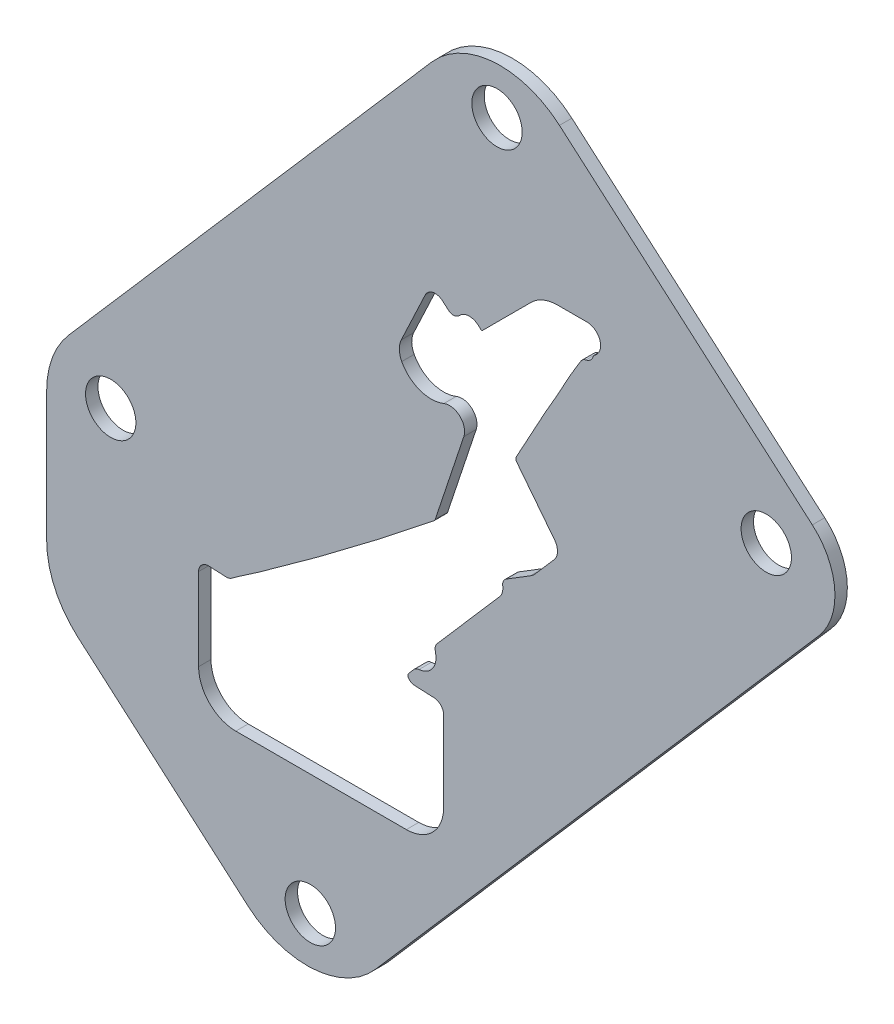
ISO-10303-21;
HEADER;
FILE_DESCRIPTION(('STEP AP214'),'2;1');
FILE_NAME('part.step','',(''),(''),'','','');
FILE_SCHEMA(('AUTOMOTIVE_DESIGN { 1 0 10303 214 1 1 1 1 }'));
ENDSEC;
DATA;
#1=APPLICATION_CONTEXT('core data for automotive mechanical design processes');
#2=APPLICATION_PROTOCOL_DEFINITION('international standard','automotive_design',2000,#1);
#3=PRODUCT_CONTEXT('',#1,'mechanical');
#4=PRODUCT('Part','Part','',(#3));
#5=PRODUCT_RELATED_PRODUCT_CATEGORY('part','',(#4));
#6=PRODUCT_DEFINITION_FORMATION('','',#4);
#7=PRODUCT_DEFINITION_CONTEXT('part definition',#1,'design');
#8=PRODUCT_DEFINITION('design','',#6,#7);
#9=PRODUCT_DEFINITION_SHAPE('','',#8);
#10=(LENGTH_UNIT() NAMED_UNIT(*) SI_UNIT(.MILLI.,.METRE.));
#11=(NAMED_UNIT(*) PLANE_ANGLE_UNIT() SI_UNIT($,.RADIAN.));
#12=(NAMED_UNIT(*) SI_UNIT($,.STERADIAN.) SOLID_ANGLE_UNIT());
#13=UNCERTAINTY_MEASURE_WITH_UNIT(LENGTH_MEASURE(1.E-05),#10,'distance_accuracy_value','');
#14=(GEOMETRIC_REPRESENTATION_CONTEXT(3) GLOBAL_UNCERTAINTY_ASSIGNED_CONTEXT((#13)) GLOBAL_UNIT_ASSIGNED_CONTEXT((#10,
#11,#12)) REPRESENTATION_CONTEXT('',''));
#15=CARTESIAN_POINT('',(0.,0.,0.));
#16=DIRECTION('',(0.,0.,1.));
#17=DIRECTION('',(1.,0.,0.));
#18=AXIS2_PLACEMENT_3D('',#15,#16,#17);
#19=CARTESIAN_POINT('',(-415.925,-60.7310959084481,-31.75));
#20=DIRECTION('',(0.,0.,1.));
#21=DIRECTION('',(1.,0.,0.));
#22=AXIS2_PLACEMENT_3D('',#19,#20,#21);
#23=CYLINDRICAL_SURFACE('',#22,18.542);
#24=CARTESIAN_POINT('',(-415.925,-60.7310959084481,-29.21));
#25=DIRECTION('',(0.,0.,1.));
#26=DIRECTION('',(1.,0.,0.));
#27=AXIS2_PLACEMENT_3D('',#24,#25,#26);
#28=CIRCLE('',#27,18.542);
#29=CARTESIAN_POINT('',(-429.924768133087,-48.573289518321,-29.21));
#30=VERTEX_POINT('',#29);
#31=CARTESIAN_POINT('',(-434.467,-60.7310959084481,-29.21));
#32=VERTEX_POINT('',#31);
#33=EDGE_CURVE('E1031',#30,#32,#28,.T.);
#34=ORIENTED_EDGE('',*,*,#33,.F.);
#35=DIRECTION('',(0.,0.,1.));
#36=VECTOR('',#35,1.);
#37=CARTESIAN_POINT('',(-429.924768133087,-48.573289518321,-31.75));
#38=LINE('',#37,#36);
#39=CARTESIAN_POINT('',(-429.924768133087,-48.573289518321,-31.75));
#40=VERTEX_POINT('',#39);
#41=EDGE_CURVE('E1112',#40,#30,#38,.T.);
#42=ORIENTED_EDGE('',*,*,#41,.F.);
#43=CARTESIAN_POINT('',(-415.925,-60.7310959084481,-31.75));
#44=DIRECTION('',(0.,0.,1.));
#45=DIRECTION('',(1.,0.,0.));
#46=AXIS2_PLACEMENT_3D('',#43,#44,#45);
#47=CIRCLE('',#46,18.542);
#48=CARTESIAN_POINT('',(-434.467,-60.7310959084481,-31.75));
#49=VERTEX_POINT('',#48);
#50=EDGE_CURVE('E1032',#40,#49,#47,.T.);
#51=ORIENTED_EDGE('',*,*,#50,.T.);
#52=DIRECTION('',(0.,0.,1.));
#53=VECTOR('',#52,1.);
#54=CARTESIAN_POINT('',(-434.467,-60.7310959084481,-31.75));
#55=LINE('',#54,#53);
#56=EDGE_CURVE('E1073',#49,#32,#55,.T.);
#57=ORIENTED_EDGE('',*,*,#56,.T.);
#58=EDGE_LOOP('',(#34,#42,#51,#57));
#59=FACE_BOUND('',#58,.T.);
#60=ADVANCED_FACE('F47',(#59),#23,.T.);
#61=CARTESIAN_POINT('',(-355.60835250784,37.0023936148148,-31.75));
#62=DIRECTION('',(-0.755030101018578,0.655690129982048,0.));
#63=DIRECTION('',(-0.655690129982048,-0.755030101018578,0.));
#64=AXIS2_PLACEMENT_3D('',#61,#62,#63);
#65=PLANE('',#64);
#66=DIRECTION('',(-0.655690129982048,-0.755030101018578,0.));
#67=VECTOR('',#66,1.);
#68=CARTESIAN_POINT('',(-355.60835250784,37.0023936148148,-29.21));
#69=LINE('',#68,#67);
#70=CARTESIAN_POINT('',(-355.60835250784,37.0023936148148,-29.21));
#71=VERTEX_POINT('',#70);
#72=EDGE_CURVE('E1037',#71,#30,#69,.T.);
#73=ORIENTED_EDGE('',*,*,#72,.F.);
#74=DIRECTION('',(0.,0.,1.));
#75=VECTOR('',#74,1.);
#76=CARTESIAN_POINT('',(-355.60835250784,37.0023936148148,-31.75));
#77=LINE('',#76,#75);
#78=CARTESIAN_POINT('',(-355.60835250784,37.0023936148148,-31.75));
#79=VERTEX_POINT('',#78);
#80=EDGE_CURVE('E1116',#79,#71,#77,.T.);
#81=ORIENTED_EDGE('',*,*,#80,.F.);
#82=DIRECTION('',(-0.655690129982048,-0.755030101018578,0.));
#83=VECTOR('',#82,1.);
#84=CARTESIAN_POINT('',(-355.60835250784,37.0023936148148,-31.75));
#85=LINE('',#84,#83);
#86=EDGE_CURVE('E1069',#79,#40,#85,.T.);
#87=ORIENTED_EDGE('',*,*,#86,.T.);
#88=ORIENTED_EDGE('',*,*,#41,.T.);
#89=EDGE_LOOP('',(#73,#81,#87,#88));
#90=FACE_BOUND('',#89,.T.);
#91=ADVANCED_FACE('F1619',(#90),#65,.T.);
#92=CARTESIAN_POINT('',(-341.608584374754,24.8445872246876,-31.75));
#93=DIRECTION('',(0.,0.,1.));
#94=DIRECTION('',(1.,0.,0.));
#95=AXIS2_PLACEMENT_3D('',#92,#93,#94);
#96=CYLINDRICAL_SURFACE('',#95,18.542);
#97=CARTESIAN_POINT('',(-341.608584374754,24.8445872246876,-29.21));
#98=DIRECTION('',(0.,0.,1.));
#99=DIRECTION('',(1.,0.,0.));
#100=AXIS2_PLACEMENT_3D('',#97,#98,#99);
#101=CIRCLE('',#100,18.542);
#102=CARTESIAN_POINT('',(-329.450777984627,38.8443553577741,-29.21));
#103=VERTEX_POINT('',#102);
#104=EDGE_CURVE('E1105',#103,#71,#101,.T.);
#105=ORIENTED_EDGE('',*,*,#104,.F.);
#106=DIRECTION('',(0.,0.,1.));
#107=VECTOR('',#106,1.);
#108=CARTESIAN_POINT('',(-329.450777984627,38.8443553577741,-31.75));
#109=LINE('',#108,#107);
#110=CARTESIAN_POINT('',(-329.450777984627,38.8443553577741,-31.75));
#111=VERTEX_POINT('',#110);
#112=EDGE_CURVE('E1119',#111,#103,#109,.T.);
#113=ORIENTED_EDGE('',*,*,#112,.F.);
#114=CARTESIAN_POINT('',(-341.608584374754,24.8445872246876,-31.75));
#115=DIRECTION('',(0.,0.,1.));
#116=DIRECTION('',(1.,0.,0.));
#117=AXIS2_PLACEMENT_3D('',#114,#115,#116);
#118=CIRCLE('',#117,18.542);
#119=EDGE_CURVE('E1065',#111,#79,#118,.T.);
#120=ORIENTED_EDGE('',*,*,#119,.T.);
#121=ORIENTED_EDGE('',*,*,#80,.T.);
#122=EDGE_LOOP('',(#105,#113,#120,#121));
#123=FACE_BOUND('',#122,.T.);
#124=ADVANCED_FACE('F1625',(#123),#96,.T.);
#125=CARTESIAN_POINT('',(-277.670813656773,-6.12287375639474,-31.75));
#126=DIRECTION('',(0.655690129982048,0.755030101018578,0.));
#127=DIRECTION('',(-0.755030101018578,0.655690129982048,0.));
#128=AXIS2_PLACEMENT_3D('',#125,#126,#127);
#129=PLANE('',#128);
#130=DIRECTION('',(-0.755030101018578,0.655690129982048,0.));
#131=VECTOR('',#130,1.);
#132=CARTESIAN_POINT('',(-277.670813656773,-6.12287375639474,-29.21));
#133=LINE('',#132,#131);
#134=CARTESIAN_POINT('',(-277.670813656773,-6.12287375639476,-29.21));
#135=VERTEX_POINT('',#134);
#136=EDGE_CURVE('E1101',#135,#103,#133,.T.);
#137=ORIENTED_EDGE('',*,*,#136,.F.);
#138=DIRECTION('',(0.,0.,1.));
#139=VECTOR('',#138,1.);
#140=CARTESIAN_POINT('',(-277.670813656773,-6.12287375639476,-31.75));
#141=LINE('',#140,#139);
#142=CARTESIAN_POINT('',(-277.670813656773,-6.12287375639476,-31.75));
#143=VERTEX_POINT('',#142);
#144=EDGE_CURVE('E1122',#143,#135,#141,.T.);
#145=ORIENTED_EDGE('',*,*,#144,.F.);
#146=DIRECTION('',(-0.755030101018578,0.655690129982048,0.));
#147=VECTOR('',#146,1.);
#148=CARTESIAN_POINT('',(-277.670813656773,-6.12287375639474,-31.75));
#149=LINE('',#148,#147);
#150=EDGE_CURVE('E1061',#143,#111,#149,.T.);
#151=ORIENTED_EDGE('',*,*,#150,.T.);
#152=ORIENTED_EDGE('',*,*,#112,.T.);
#153=EDGE_LOOP('',(#137,#145,#151,#152));
#154=FACE_BOUND('',#153,.T.);
#155=ADVANCED_FACE('F1736',(#154),#129,.T.);
#156=CARTESIAN_POINT('',(-286.497714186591,-16.2870889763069,-31.75));
#157=DIRECTION('',(0.,0.,1.));
#158=DIRECTION('',(1.,0.,0.));
#159=AXIS2_PLACEMENT_3D('',#156,#157,#158);
#160=CYLINDRICAL_SURFACE('',#159,13.462);
#161=CARTESIAN_POINT('',(-286.497714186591,-16.2870889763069,-29.21));
#162=DIRECTION('',(0.,0.,1.));
#163=DIRECTION('',(1.,0.,0.));
#164=AXIS2_PLACEMENT_3D('',#161,#162,#163);
#165=CIRCLE('',#164,13.462);
#166=CARTESIAN_POINT('',(-276.333498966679,-25.1139895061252,-29.21));
#167=VERTEX_POINT('',#166);
#168=EDGE_CURVE('E1097',#167,#135,#165,.T.);
#169=ORIENTED_EDGE('',*,*,#168,.F.);
#170=DIRECTION('',(0.,0.,1.));
#171=VECTOR('',#170,1.);
#172=CARTESIAN_POINT('',(-276.333498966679,-25.1139895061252,-31.75));
#173=LINE('',#172,#171);
#174=CARTESIAN_POINT('',(-276.333498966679,-25.1139895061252,-31.75));
#175=VERTEX_POINT('',#174);
#176=EDGE_CURVE('E1125',#175,#167,#173,.T.);
#177=ORIENTED_EDGE('',*,*,#176,.F.);
#178=CARTESIAN_POINT('',(-286.497714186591,-16.2870889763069,-31.75));
#179=DIRECTION('',(0.,0.,1.));
#180=DIRECTION('',(1.,0.,0.));
#181=AXIS2_PLACEMENT_3D('',#178,#179,#180);
#182=CIRCLE('',#181,13.462);
#183=EDGE_CURVE('E1057',#175,#143,#182,.T.);
#184=ORIENTED_EDGE('',*,*,#183,.T.);
#185=ORIENTED_EDGE('',*,*,#144,.T.);
#186=EDGE_LOOP('',(#169,#177,#184,#185));
#187=FACE_BOUND('',#186,.T.);
#188=ADVANCED_FACE('F1726',(#187),#160,.T.);
#189=CARTESIAN_POINT('',(-367.100683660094,-129.632806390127,-31.75));
#190=DIRECTION('',(0.755030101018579,-0.655690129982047,0.));
#191=DIRECTION('',(0.655690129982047,0.755030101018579,0.));
#192=AXIS2_PLACEMENT_3D('',#189,#190,#191);
#193=PLANE('',#192);
#194=DIRECTION('',(0.655690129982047,0.755030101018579,0.));
#195=VECTOR('',#194,1.);
#196=CARTESIAN_POINT('',(-367.100683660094,-129.632806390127,-29.21));
#197=LINE('',#196,#195);
#198=CARTESIAN_POINT('',(-367.100683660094,-129.632806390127,-29.21));
#199=VERTEX_POINT('',#198);
#200=EDGE_CURVE('E1093',#199,#167,#197,.T.);
#201=ORIENTED_EDGE('',*,*,#200,.F.);
#202=DIRECTION('',(0.,0.,1.));
#203=VECTOR('',#202,1.);
#204=CARTESIAN_POINT('',(-367.100683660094,-129.632806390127,-31.75));
#205=LINE('',#204,#203);
#206=CARTESIAN_POINT('',(-367.100683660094,-129.632806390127,-31.75));
#207=VERTEX_POINT('',#206);
#208=EDGE_CURVE('E1128',#207,#199,#205,.T.);
#209=ORIENTED_EDGE('',*,*,#208,.F.);
#210=DIRECTION('',(0.655690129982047,0.755030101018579,0.));
#211=VECTOR('',#210,1.);
#212=CARTESIAN_POINT('',(-367.100683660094,-129.632806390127,-31.75));
#213=LINE('',#212,#211);
#214=EDGE_CURVE('E1053',#207,#175,#213,.T.);
#215=ORIENTED_EDGE('',*,*,#214,.T.);
#216=ORIENTED_EDGE('',*,*,#176,.T.);
#217=EDGE_LOOP('',(#201,#209,#215,#216));
#218=FACE_BOUND('',#217,.T.);
#219=ADVANCED_FACE('F1716',(#218),#193,.T.);
#220=CARTESIAN_POINT('',(-381.10045179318,-117.475,-31.75));
#221=DIRECTION('',(0.,0.,1.));
#222=DIRECTION('',(1.,0.,0.));
#223=AXIS2_PLACEMENT_3D('',#220,#221,#222);
#224=CYLINDRICAL_SURFACE('',#223,18.542);
#225=CARTESIAN_POINT('',(-381.10045179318,-117.475,-29.21));
#226=DIRECTION('',(0.,0.,1.));
#227=DIRECTION('',(1.,0.,0.));
#228=AXIS2_PLACEMENT_3D('',#225,#226,#227);
#229=CIRCLE('',#228,18.542);
#230=CARTESIAN_POINT('',(-393.258258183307,-131.474768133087,-29.21));
#231=VERTEX_POINT('',#230);
#232=EDGE_CURVE('E1089',#231,#199,#229,.T.);
#233=ORIENTED_EDGE('',*,*,#232,.F.);
#234=DIRECTION('',(0.,0.,1.));
#235=VECTOR('',#234,1.);
#236=CARTESIAN_POINT('',(-393.258258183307,-131.474768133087,-31.75));
#237=LINE('',#236,#235);
#238=CARTESIAN_POINT('',(-393.258258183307,-131.474768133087,-31.75));
#239=VERTEX_POINT('',#238);
#240=EDGE_CURVE('E1131',#239,#231,#237,.T.);
#241=ORIENTED_EDGE('',*,*,#240,.F.);
#242=CARTESIAN_POINT('',(-381.10045179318,-117.475,-31.75));
#243=DIRECTION('',(0.,0.,1.));
#244=DIRECTION('',(1.,0.,0.));
#245=AXIS2_PLACEMENT_3D('',#242,#243,#244);
#246=CIRCLE('',#245,18.542);
#247=EDGE_CURVE('E1049',#239,#207,#246,.T.);
#248=ORIENTED_EDGE('',*,*,#247,.T.);
#249=ORIENTED_EDGE('',*,*,#208,.T.);
#250=EDGE_LOOP('',(#233,#241,#248,#249));
#251=FACE_BOUND('',#250,.T.);
#252=ADVANCED_FACE('F1706',(#251),#224,.T.);
#253=CARTESIAN_POINT('',(-428.082806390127,-101.232116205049,-31.75));
#254=DIRECTION('',(-0.655690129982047,-0.755030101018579,0.));
#255=DIRECTION('',(0.755030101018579,-0.655690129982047,0.));
#256=AXIS2_PLACEMENT_3D('',#253,#254,#255);
#257=PLANE('',#256);
#258=DIRECTION('',(0.755030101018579,-0.655690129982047,0.));
#259=VECTOR('',#258,1.);
#260=CARTESIAN_POINT('',(-428.082806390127,-101.232116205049,-29.21));
#261=LINE('',#260,#259);
#262=CARTESIAN_POINT('',(-428.082806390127,-101.232116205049,-29.21));
#263=VERTEX_POINT('',#262);
#264=EDGE_CURVE('E1085',#263,#231,#261,.T.);
#265=ORIENTED_EDGE('',*,*,#264,.F.);
#266=DIRECTION('',(0.,0.,1.));
#267=VECTOR('',#266,1.);
#268=CARTESIAN_POINT('',(-428.082806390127,-101.232116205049,-31.75));
#269=LINE('',#268,#267);
#270=CARTESIAN_POINT('',(-428.082806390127,-101.232116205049,-31.75));
#271=VERTEX_POINT('',#270);
#272=EDGE_CURVE('E1134',#271,#263,#269,.T.);
#273=ORIENTED_EDGE('',*,*,#272,.F.);
#274=DIRECTION('',(0.755030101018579,-0.655690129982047,0.));
#275=VECTOR('',#274,1.);
#276=CARTESIAN_POINT('',(-428.082806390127,-101.232116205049,-31.75));
#277=LINE('',#276,#275);
#278=EDGE_CURVE('E1045',#271,#239,#277,.T.);
#279=ORIENTED_EDGE('',*,*,#278,.T.);
#280=ORIENTED_EDGE('',*,*,#240,.T.);
#281=EDGE_LOOP('',(#265,#273,#279,#280));
#282=FACE_BOUND('',#281,.T.);
#283=ADVANCED_FACE('F1697',(#282),#257,.T.);
#284=CARTESIAN_POINT('',(-415.925,-87.2323480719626,-31.75));
#285=DIRECTION('',(0.,0.,1.));
#286=DIRECTION('',(1.,0.,0.));
#287=AXIS2_PLACEMENT_3D('',#284,#285,#286);
#288=CYLINDRICAL_SURFACE('',#287,18.5420000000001);
#289=CARTESIAN_POINT('',(-415.925,-87.2323480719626,-29.21));
#290=DIRECTION('',(0.,0.,1.));
#291=DIRECTION('',(1.,0.,0.));
#292=AXIS2_PLACEMENT_3D('',#289,#290,#291);
#293=CIRCLE('',#292,18.5420000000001);
#294=CARTESIAN_POINT('',(-434.467,-87.2323480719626,-29.21));
#295=VERTEX_POINT('',#294);
#296=EDGE_CURVE('E1081',#295,#263,#293,.T.);
#297=ORIENTED_EDGE('',*,*,#296,.F.);
#298=DIRECTION('',(0.,0.,1.));
#299=VECTOR('',#298,1.);
#300=CARTESIAN_POINT('',(-434.467,-87.2323480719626,-31.75));
#301=LINE('',#300,#299);
#302=CARTESIAN_POINT('',(-434.467,-87.2323480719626,-31.75));
#303=VERTEX_POINT('',#302);
#304=EDGE_CURVE('E1137',#303,#295,#301,.T.);
#305=ORIENTED_EDGE('',*,*,#304,.F.);
#306=CARTESIAN_POINT('',(-415.925,-87.2323480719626,-31.75));
#307=DIRECTION('',(0.,0.,1.));
#308=DIRECTION('',(1.,0.,0.));
#309=AXIS2_PLACEMENT_3D('',#306,#307,#308);
#310=CIRCLE('',#309,18.5420000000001);
#311=EDGE_CURVE('E1041',#303,#271,#310,.T.);
#312=ORIENTED_EDGE('',*,*,#311,.T.);
#313=ORIENTED_EDGE('',*,*,#272,.T.);
#314=EDGE_LOOP('',(#297,#305,#312,#313));
#315=FACE_BOUND('',#314,.T.);
#316=ADVANCED_FACE('F1687',(#315),#288,.T.);
#317=CARTESIAN_POINT('',(-434.467,-60.7310959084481,-31.75));
#318=DIRECTION('',(-1.,0.,0.));
#319=DIRECTION('',(0.,0.,1.));
#320=AXIS2_PLACEMENT_3D('',#317,#318,#319);
#321=PLANE('',#320);
#322=DIRECTION('',(0.,-1.,0.));
#323=VECTOR('',#322,1.);
#324=CARTESIAN_POINT('',(-434.467,-60.7310959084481,-29.21));
#325=LINE('',#324,#323);
#326=EDGE_CURVE('E1077',#32,#295,#325,.T.);
#327=ORIENTED_EDGE('',*,*,#326,.F.);
#328=ORIENTED_EDGE('',*,*,#56,.F.);
#329=DIRECTION('',(0.,-1.,0.));
#330=VECTOR('',#329,1.);
#331=CARTESIAN_POINT('',(-434.467,-60.7310959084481,-31.75));
#332=LINE('',#331,#330);
#333=EDGE_CURVE('E1036',#49,#303,#332,.T.);
#334=ORIENTED_EDGE('',*,*,#333,.T.);
#335=ORIENTED_EDGE('',*,*,#304,.T.);
#336=EDGE_LOOP('',(#327,#328,#334,#335));
#337=FACE_BOUND('',#336,.T.);
#338=ADVANCED_FACE('F1631',(#337),#321,.T.);
#339=CARTESIAN_POINT('',(-415.925,-60.7310959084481,-31.75));
#340=DIRECTION('',(0.,0.,1.));
#341=DIRECTION('',(1.,0.,0.));
#342=AXIS2_PLACEMENT_3D('',#339,#340,#341);
#343=PLANE('',#342);
#344=DIRECTION('',(-0.755030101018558,0.655690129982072,0.));
#345=VECTOR('',#344,1.);
#346=CARTESIAN_POINT('',(-359.690046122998,-75.294750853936,-31.75));
#347=LINE('',#346,#345);
#348=CARTESIAN_POINT('',(-360.105967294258,-74.9335527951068,-31.75));
#349=VERTEX_POINT('',#348);
#350=CARTESIAN_POINT('',(-360.203769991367,-74.8486180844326,-31.75));
#351=VERTEX_POINT('',#350);
#352=EDGE_CURVE('E605',#349,#351,#347,.T.);
#353=ORIENTED_EDGE('',*,*,#352,.T.);
#354=CARTESIAN_POINT('',(-359.683315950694,-74.2493129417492,-31.75));
#355=DIRECTION('',(0.,0.,1.));
#356=DIRECTION('',(1.,0.,0.));
#357=AXIS2_PLACEMENT_3D('',#354,#355,#356);
#358=CIRCLE('',#357,0.79375);
#359=CARTESIAN_POINT('',(-360.282620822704,-73.7288585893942,-31.75));
#360=VERTEX_POINT('',#359);
#361=EDGE_CURVE('E11',#351,#360,#358,.F.);
#362=ORIENTED_EDGE('',*,*,#361,.T.);
#363=DIRECTION('',(0.655690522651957,0.755029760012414,0.));
#364=VECTOR('',#363,1.);
#365=CARTESIAN_POINT('',(-360.803075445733,-74.3281637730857,-31.75));
#366=LINE('',#365,#364);
#367=CARTESIAN_POINT('',(-359.288923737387,-72.5846131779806,-31.75));
#368=VERTEX_POINT('',#367);
#369=EDGE_CURVE('E608',#360,#368,#366,.T.);
#370=ORIENTED_EDGE('',*,*,#369,.T.);
#371=CARTESIAN_POINT('',(-358.090313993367,-73.6255218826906,-31.75));
#372=DIRECTION('',(0.,0.,1.));
#373=DIRECTION('',(1.,0.,0.));
#374=AXIS2_PLACEMENT_3D('',#371,#372,#373);
#375=CIRCLE('',#374,1.5875);
#376=CARTESIAN_POINT('',(-358.214095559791,-72.0428550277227,-31.75));
#377=VERTEX_POINT('',#376);
#378=EDGE_CURVE('E1167',#368,#377,#375,.F.);
#379=ORIENTED_EDGE('',*,*,#378,.T.);
#380=CARTESIAN_POINT('',(-358.50805204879,-68.2843374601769,-31.75));
#381=DIRECTION('',(0.,0.,1.));
#382=DIRECTION('',(1.,0.,0.));
#383=AXIS2_PLACEMENT_3D('',#380,#381,#382);
#384=CIRCLE('',#383,3.76999532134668);
#385=CARTESIAN_POINT('',(-354.765382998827,-67.8312446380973,-31.75));
#386=VERTEX_POINT('',#385);
#387=EDGE_CURVE('E611',#377,#386,#384,.T.);
#388=ORIENTED_EDGE('',*,*,#387,.T.);
#389=DIRECTION('',(-0.120177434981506,0.992752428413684,0.));
#390=VECTOR('',#389,1.);
#391=CARTESIAN_POINT('',(-354.765382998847,-67.8312446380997,-31.75));
#392=LINE('',#391,#390);
#393=CARTESIAN_POINT('',(-354.822446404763,-67.3598596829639,-31.75));
#394=VERTEX_POINT('',#393);
#395=EDGE_CURVE('E614',#386,#394,#392,.T.);
#396=ORIENTED_EDGE('',*,*,#395,.T.);
#397=CARTESIAN_POINT('',(-358.565115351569,-67.8129922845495,-31.75));
#398=DIRECTION('',(0.,0.,1.));
#399=DIRECTION('',(1.,0.,0.));
#400=AXIS2_PLACEMENT_3D('',#397,#398,#399);
#401=CIRCLE('',#400,3.77000000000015);
#402=CARTESIAN_POINT('',(-354.881497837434,-67.0105821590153,-31.75));
#403=VERTEX_POINT('',#402);
#404=EDGE_CURVE('E618',#394,#403,#401,.T.);
#405=ORIENTED_EDGE('',*,*,#404,.T.);
#406=CARTESIAN_POINT('',(-353.330372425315,-66.6726972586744,-31.75));
#407=DIRECTION('',(0.,0.,1.));
#408=DIRECTION('',(1.,0.,0.));
#409=AXIS2_PLACEMENT_3D('',#406,#407,#408);
#410=CIRCLE('',#409,1.5875);
#411=CARTESIAN_POINT('',(-354.52898280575,-65.6317892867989,-31.75));
#412=VERTEX_POINT('',#411);
#413=EDGE_CURVE('E1179',#403,#412,#410,.F.);
#414=ORIENTED_EDGE('',*,*,#413,.T.);
#415=DIRECTION('',(0.655690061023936,0.755030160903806,0.));
#416=VECTOR('',#415,1.);
#417=CARTESIAN_POINT('',(-355.111111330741,-66.3021129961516,-31.75));
#418=LINE('',#417,#416);
#419=CARTESIAN_POINT('',(-341.724092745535,-50.8868987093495,-31.75));
#420=VERTEX_POINT('',#419);
#421=EDGE_CURVE('E622',#412,#420,#418,.T.);
#422=ORIENTED_EDGE('',*,*,#421,.T.);
#423=CARTESIAN_POINT('',(-343.833647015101,-49.0549006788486,-31.75));
#424=DIRECTION('',(0.,0.,1.));
#425=DIRECTION('',(1.,0.,0.));
#426=AXIS2_PLACEMENT_3D('',#423,#424,#425);
#427=CIRCLE('',#426,2.79400000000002);
#428=CARTESIAN_POINT('',(-341.069989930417,-48.6442481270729,-31.75));
#429=VERTEX_POINT('',#428);
#430=EDGE_CURVE('E625',#420,#429,#427,.T.);
#431=ORIENTED_EDGE('',*,*,#430,.T.);
#432=CARTESIAN_POINT('',(-339.499730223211,-48.4109228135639,-31.75));
#433=DIRECTION('',(0.,0.,1.));
#434=DIRECTION('',(1.,0.,0.));
#435=AXIS2_PLACEMENT_3D('',#432,#433,#434);
#436=CIRCLE('',#435,1.5875);
#437=CARTESIAN_POINT('',(-340.333302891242,-47.0598814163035,-31.75));
#438=VERTEX_POINT('',#437);
#439=EDGE_CURVE('E1170',#429,#438,#436,.F.);
#440=ORIENTED_EDGE('',*,*,#439,.T.);
#441=DIRECTION('',(0.851049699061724,0.52508514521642,0.));
#442=VECTOR('',#441,1.);
#443=CARTESIAN_POINT('',(-341.385232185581,-47.7089063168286,-31.75));
#444=LINE('',#443,#442);
#445=CARTESIAN_POINT('',(-335.420274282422,-44.028615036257,-31.75));
#446=VERTEX_POINT('',#445);
#447=EDGE_CURVE('E629',#438,#446,#444,.T.);
#448=ORIENTED_EDGE('',*,*,#447,.T.);
#449=CARTESIAN_POINT('',(-337.754277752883,-40.2456991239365,-31.75));
#450=DIRECTION('',(0.,0.,1.));
#451=DIRECTION('',(1.,0.,0.));
#452=AXIS2_PLACEMENT_3D('',#449,#450,#451);
#453=CIRCLE('',#452,4.44499999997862);
#454=CARTESIAN_POINT('',(-334.398168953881,-43.1602417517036,-31.75));
#455=VERTEX_POINT('',#454);
#456=EDGE_CURVE('E632',#446,#455,#453,.T.);
#457=ORIENTED_EDGE('',*,*,#456,.T.);
#458=DIRECTION('',(0.655690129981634,0.755030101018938,0.));
#459=VECTOR('',#458,1.);
#460=CARTESIAN_POINT('',(-334.398168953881,-43.1602417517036,-31.75));
#461=LINE('',#460,#459);
#462=CARTESIAN_POINT('',(-330.541734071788,-38.7195398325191,-31.75));
#463=VERTEX_POINT('',#462);
#464=EDGE_CURVE('E636',#455,#463,#461,.T.);
#465=ORIENTED_EDGE('',*,*,#464,.T.);
#466=CARTESIAN_POINT('',(-332.651288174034,-36.8875416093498,-31.75));
#467=DIRECTION('',(0.,0.,1.));
#468=DIRECTION('',(1.,0.,0.));
#469=AXIS2_PLACEMENT_3D('',#466,#467,#468);
#470=CIRCLE('',#469,2.79400000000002);
#471=CARTESIAN_POINT('',(-330.450427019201,-35.1663076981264,-31.75));
#472=VERTEX_POINT('',#471);
#473=EDGE_CURVE('E640',#463,#472,#470,.T.);
#474=ORIENTED_EDGE('',*,*,#473,.T.);
#475=DIRECTION('',(-0.616046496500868,0.787709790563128,0.));
#476=VECTOR('',#475,1.);
#477=CARTESIAN_POINT('',(-330.450427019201,-35.1663076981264,-31.75));
#478=LINE('',#477,#476);
#479=CARTESIAN_POINT('',(-338.24577181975,-25.1987655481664,-31.75));
#480=VERTEX_POINT('',#479);
#481=EDGE_CURVE('E644',#472,#480,#478,.T.);
#482=ORIENTED_EDGE('',*,*,#481,.T.);
#483=CARTESIAN_POINT('',(-337.670741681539,-24.7490541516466,-31.75));
#484=DIRECTION('',(0.,0.,-1.));
#485=DIRECTION('',(1.,0.,0.));
#486=AXIS2_PLACEMENT_3D('',#483,#484,#485);
#487=CIRCLE('',#486,0.730000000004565);
#488=CARTESIAN_POINT('',(-338.311367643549,-24.3990564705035,-31.75));
#489=VERTEX_POINT('',#488);
#490=EDGE_CURVE('E648',#480,#489,#487,.T.);
#491=ORIENTED_EDGE('',*,*,#490,.T.);
#492=DIRECTION('',(0.479448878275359,0.877569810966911,0.));
#493=VECTOR('',#492,1.);
#494=CARTESIAN_POINT('',(-338.311367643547,-24.3990564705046,-31.75));
#495=LINE('',#494,#493);
#496=CARTESIAN_POINT('',(-332.466908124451,-13.7015213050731,-31.75));
#497=VERTEX_POINT('',#496);
#498=EDGE_CURVE('E652',#489,#497,#495,.T.);
#499=ORIENTED_EDGE('',*,*,#498,.T.);
#500=DIRECTION('',(0.497982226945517,0.867187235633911,0.));
#501=VECTOR('',#500,1.);
#502=CARTESIAN_POINT('',(-332.466908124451,-13.7015213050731,-31.75));
#503=LINE('',#502,#501);
#504=CARTESIAN_POINT('',(-329.884539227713,-9.20457899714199,-31.75));
#505=VERTEX_POINT('',#504);
#506=EDGE_CURVE('E656',#497,#505,#503,.T.);
#507=ORIENTED_EDGE('',*,*,#506,.T.);
#508=DIRECTION('',(0.479448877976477,0.877569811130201,0.));
#509=VECTOR('',#508,1.);
#510=CARTESIAN_POINT('',(-329.884539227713,-9.20457899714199,-31.75));
#511=LINE('',#510,#509);
#512=CARTESIAN_POINT('',(-327.710288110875,-5.22489058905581,-31.75));
#513=VERTEX_POINT('',#512);
#514=EDGE_CURVE('E660',#505,#513,#511,.T.);
#515=ORIENTED_EDGE('',*,*,#514,.T.);
#516=CARTESIAN_POINT('',(-246.298222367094,-50.4460704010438,-31.75));
#517=DIRECTION('',(0.,0.,-1.));
#518=DIRECTION('',(1.,0.,0.));
#519=AXIS2_PLACEMENT_3D('',#516,#517,#518);
#520=CIRCLE('',#519,93.1282961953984);
#521=CARTESIAN_POINT('',(-327.285490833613,-4.46844651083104,-31.75));
#522=VERTEX_POINT('',#521);
#523=EDGE_CURVE('E664',#513,#522,#520,.T.);
#524=ORIENTED_EDGE('',*,*,#523,.T.);
#525=CARTESIAN_POINT('',(-295.384101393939,-22.8808363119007,-31.75));
#526=DIRECTION('',(0.,0.,-1.));
#527=DIRECTION('',(1.,0.,0.));
#528=AXIS2_PLACEMENT_3D('',#525,#526,#527);
#529=CIRCLE('',#528,36.8336089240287);
#530=CARTESIAN_POINT('',(-326.843935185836,-3.72375918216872,-31.75));
#531=VERTEX_POINT('',#530);
#532=EDGE_CURVE('E668',#522,#531,#529,.T.);
#533=ORIENTED_EDGE('',*,*,#532,.T.);
#534=CARTESIAN_POINT('',(-213.805214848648,-69.953775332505,-31.75));
#535=DIRECTION('',(0.,0.,-1.));
#536=DIRECTION('',(1.,0.,0.));
#537=AXIS2_PLACEMENT_3D('',#534,#535,#536);
#538=CIRCLE('',#537,131.012088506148);
#539=CARTESIAN_POINT('',(-325.059149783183,-0.767582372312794,-31.75));
#540=VERTEX_POINT('',#539);
#541=EDGE_CURVE('E672',#531,#540,#538,.T.);
#542=ORIENTED_EDGE('',*,*,#541,.T.);
#543=CARTESIAN_POINT('',(-323.711063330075,-1.60592547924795,-31.75));
#544=DIRECTION('',(0.,0.,1.));
#545=DIRECTION('',(1.,0.,0.));
#546=AXIS2_PLACEMENT_3D('',#543,#544,#545);
#547=CIRCLE('',#546,1.5875);
#548=CARTESIAN_POINT('',(-324.014157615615,-0.0476282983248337,-31.75));
#549=VERTEX_POINT('',#548);
#550=EDGE_CURVE('E1176',#540,#549,#547,.F.);
#551=ORIENTED_EDGE('',*,*,#550,.T.);
#552=CARTESIAN_POINT('',(-324.369025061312,1.77684997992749,-31.75));
#553=DIRECTION('',(0.,0.,1.));
#554=DIRECTION('',(1.,0.,0.));
#555=AXIS2_PLACEMENT_3D('',#552,#553,#554);
#556=CIRCLE('',#555,1.85866938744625);
#557=CARTESIAN_POINT('',(-322.665465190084,1.03352255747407,-31.75));
#558=VERTEX_POINT('',#557);
#559=EDGE_CURVE('E676',#549,#558,#556,.T.);
#560=ORIENTED_EDGE('',*,*,#559,.T.);
#561=CARTESIAN_POINT('',(-274.821127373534,-19.8427665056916,-31.75));
#562=DIRECTION('',(0.,0.,-1.));
#563=DIRECTION('',(1.,0.,0.));
#564=AXIS2_PLACEMENT_3D('',#561,#562,#563);
#565=CIRCLE('',#564,52.2005757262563);
#566=CARTESIAN_POINT('',(-322.464972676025,1.48712123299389,-31.75));
#567=VERTEX_POINT('',#566);
#568=EDGE_CURVE('E679',#558,#567,#565,.T.);
#569=ORIENTED_EDGE('',*,*,#568,.T.);
#570=CARTESIAN_POINT('',(-322.233145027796,1.3833332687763,-31.75));
#571=DIRECTION('',(0.,0.,-1.));
#572=DIRECTION('',(1.,0.,0.));
#573=AXIS2_PLACEMENT_3D('',#570,#571,#572);
#574=CIRCLE('',#573,0.253999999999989);
#575=CARTESIAN_POINT('',(-322.365506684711,1.60011978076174,-31.75));
#576=VERTEX_POINT('',#575);
#577=EDGE_CURVE('E480',#567,#576,#574,.T.);
#578=ORIENTED_EDGE('',*,*,#577,.T.);
#579=CARTESIAN_POINT('',(-323.821484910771,3.98477141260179,-31.75));
#580=DIRECTION('',(0.,0.,1.));
#581=DIRECTION('',(1.,0.,0.));
#582=AXIS2_PLACEMENT_3D('',#579,#580,#581);
#583=CIRCLE('',#582,2.79400000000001);
#584=CARTESIAN_POINT('',(-323.821484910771,6.7787714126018,-31.75));
#585=VERTEX_POINT('',#584);
#586=EDGE_CURVE('E471',#576,#585,#583,.T.);
#587=ORIENTED_EDGE('',*,*,#586,.T.);
#588=DIRECTION('',(-1.,0.,0.));
#589=VECTOR('',#588,1.);
#590=CARTESIAN_POINT('',(-323.821484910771,6.7787714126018,-31.75));
#591=LINE('',#590,#589);
#592=CARTESIAN_POINT('',(-329.866864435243,6.77877141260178,-31.75));
#593=VERTEX_POINT('',#592);
#594=EDGE_CURVE('E484',#585,#593,#591,.T.);
#595=ORIENTED_EDGE('',*,*,#594,.T.);
#596=CARTESIAN_POINT('',(-329.866864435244,-0.841228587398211,-31.75));
#597=DIRECTION('',(0.,0.,1.));
#598=DIRECTION('',(1.,0.,0.));
#599=AXIS2_PLACEMENT_3D('',#596,#597,#598);
#600=CIRCLE('',#599,7.61999999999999);
#601=CARTESIAN_POINT('',(-335.255018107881,4.54692508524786,-31.75));
#602=VERTEX_POINT('',#601);
#603=EDGE_CURVE('E489',#593,#602,#600,.T.);
#604=ORIENTED_EDGE('',*,*,#603,.T.);
#605=DIRECTION('',(-0.707106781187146,-0.707106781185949,0.));
#606=VECTOR('',#605,1.);
#607=CARTESIAN_POINT('',(-335.255018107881,4.54692508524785,-31.75));
#608=LINE('',#607,#606);
#609=CARTESIAN_POINT('',(-345.215586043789,-5.41364285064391,-31.75));
#610=VERTEX_POINT('',#609);
#611=EDGE_CURVE('E506',#602,#610,#608,.T.);
#612=ORIENTED_EDGE('',*,*,#611,.T.);
#613=CARTESIAN_POINT('',(-345.395191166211,-5.23403772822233,-31.75));
#614=DIRECTION('',(0.,0.,-1.));
#615=DIRECTION('',(1.,0.,0.));
#616=AXIS2_PLACEMENT_3D('',#613,#614,#615);
#617=CIRCLE('',#616,0.254000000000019);
#618=CARTESIAN_POINT('',(-345.574796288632,-5.41364285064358,-31.75));
#619=VERTEX_POINT('',#618);
#620=EDGE_CURVE('E510',#610,#619,#617,.T.);
#621=ORIENTED_EDGE('',*,*,#620,.T.);
#622=DIRECTION('',(-0.707106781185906,0.707106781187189,0.));
#623=VECTOR('',#622,1.);
#624=CARTESIAN_POINT('',(-345.574796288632,-5.41364285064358,-31.75));
#625=LINE('',#624,#623);
#626=CARTESIAN_POINT('',(-345.934006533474,-5.05443260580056,-31.75));
#627=VERTEX_POINT('',#626);
#628=EDGE_CURVE('E514',#619,#627,#625,.T.);
#629=ORIENTED_EDGE('',*,*,#628,.T.);
#630=CARTESIAN_POINT('',(-347.909662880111,-7.03008895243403,-31.75));
#631=DIRECTION('',(0.,0.,1.));
#632=DIRECTION('',(1.,0.,0.));
#633=AXIS2_PLACEMENT_3D('',#630,#631,#632);
#634=CIRCLE('',#633,2.79400000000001);
#635=CARTESIAN_POINT('',(-349.984117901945,-5.15843931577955,-31.75));
#636=VERTEX_POINT('',#635);
#637=EDGE_CURVE('E518',#627,#636,#634,.T.);
#638=ORIENTED_EDGE('',*,*,#637,.T.);
#639=CARTESIAN_POINT('',(-351.162785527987,-4.09500202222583,-31.75));
#640=DIRECTION('',(0.,0.,1.));
#641=DIRECTION('',(1.,0.,0.));
#642=AXIS2_PLACEMENT_3D('',#639,#640,#641);
#643=CIRCLE('',#642,1.5875);
#644=CARTESIAN_POINT('',(-352.203693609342,-5.29361230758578,-31.75));
#645=VERTEX_POINT('',#644);
#646=EDGE_CURVE('E1173',#636,#645,#643,.F.);
#647=ORIENTED_EDGE('',*,*,#646,.T.);
#648=DIRECTION('',(-0.755030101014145,0.655690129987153,0.));
#649=VECTOR('',#648,1.);
#650=CARTESIAN_POINT('',(-350.673739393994,-6.62226910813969,-31.75));
#651=LINE('',#650,#649);
#652=CARTESIAN_POINT('',(-353.407010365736,-4.24861698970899,-31.75));
#653=VERTEX_POINT('',#652);
#654=EDGE_CURVE('E522',#645,#653,#651,.T.);
#655=ORIENTED_EDGE('',*,*,#654,.T.);
#656=CARTESIAN_POINT('',(-354.895426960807,-5.9625353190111,-31.75));
#657=DIRECTION('',(0.,0.,1.));
#658=DIRECTION('',(1.,0.,0.));
#659=AXIS2_PLACEMENT_3D('',#656,#657,#658);
#660=CIRCLE('',#659,2.26999999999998);
#661=CARTESIAN_POINT('',(-356.949396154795,-4.99604137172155,-31.75));
#662=VERTEX_POINT('',#661);
#663=EDGE_CURVE('E525',#653,#662,#660,.T.);
#664=ORIENTED_EDGE('',*,*,#663,.T.);
#665=DIRECTION('',(-0.425768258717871,-0.904832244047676,0.));
#666=VECTOR('',#665,1.);
#667=CARTESIAN_POINT('',(-356.949396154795,-4.99604137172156,-31.75));
#668=LINE('',#667,#666);
#669=CARTESIAN_POINT('',(-361.837583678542,-15.3842974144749,-31.75));
#670=VERTEX_POINT('',#669);
#671=EDGE_CURVE('E529',#662,#670,#668,.T.);
#672=ORIENTED_EDGE('',*,*,#671,.T.);
#673=CARTESIAN_POINT('',(-357.977308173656,-17.2007476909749,-31.75));
#674=DIRECTION('',(0.,0.,1.));
#675=DIRECTION('',(1.,0.,0.));
#676=AXIS2_PLACEMENT_3D('',#673,#674,#675);
#677=CIRCLE('',#676,4.26628861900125);
#678=CARTESIAN_POINT('',(-361.748332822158,-19.1958897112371,-31.75));
#679=VERTEX_POINT('',#678);
#680=EDGE_CURVE('E533',#670,#679,#677,.T.);
#681=ORIENTED_EDGE('',*,*,#680,.T.);
#682=CARTESIAN_POINT('',(-355.705949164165,-15.9990361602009,-31.75));
#683=DIRECTION('',(0.,0.,1.));
#684=DIRECTION('',(1.,0.,0.));
#685=AXIS2_PLACEMENT_3D('',#682,#683,#684);
#686=CIRCLE('',#685,6.83595442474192);
#687=CARTESIAN_POINT('',(-353.124227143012,-22.3287268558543,-31.75));
#688=VERTEX_POINT('',#687);
#689=EDGE_CURVE('E537',#679,#688,#686,.T.);
#690=ORIENTED_EDGE('',*,*,#689,.T.);
#691=CARTESIAN_POINT('',(-351.961009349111,-25.1806252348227,-31.75));
#692=DIRECTION('',(0.,0.,-1.));
#693=DIRECTION('',(1.,0.,0.));
#694=AXIS2_PLACEMENT_3D('',#691,#692,#693);
#695=CIRCLE('',#694,3.08000000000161);
#696=CARTESIAN_POINT('',(-349.03831819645,-26.1523641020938,-31.75));
#697=VERTEX_POINT('',#696);
#698=EDGE_CURVE('E541',#688,#697,#695,.T.);
#699=ORIENTED_EDGE('',*,*,#698,.T.);
#700=DIRECTION('',(-0.315500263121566,-0.948925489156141,0.));
#701=VECTOR('',#700,1.);
#702=CARTESIAN_POINT('',(-349.03831819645,-26.1523641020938,-31.75));
#703=LINE('',#702,#701);
#704=CARTESIAN_POINT('',(-354.893029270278,-43.76149226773,-31.75));
#705=VERTEX_POINT('',#704);
#706=EDGE_CURVE('E545',#697,#705,#703,.T.);
#707=ORIENTED_EDGE('',*,*,#706,.T.);
#708=CARTESIAN_POINT('',(-355.585744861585,-43.5311770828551,-31.75));
#709=DIRECTION('',(0.,0.,-1.));
#710=DIRECTION('',(1.,0.,0.));
#711=AXIS2_PLACEMENT_3D('',#708,#709,#710);
#712=CIRCLE('',#711,0.729999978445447);
#713=CARTESIAN_POINT('',(-355.127519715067,-44.0994461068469,-31.75));
#714=VERTEX_POINT('',#713);
#715=EDGE_CURVE('E549',#705,#714,#712,.T.);
#716=ORIENTED_EDGE('',*,*,#715,.T.);
#717=CARTESIAN_POINT('',(-793.724322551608,499.827439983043,-31.75));
#718=DIRECTION('',(0.,0.,-1.));
#719=DIRECTION('',(1.,0.,0.));
#720=AXIS2_PLACEMENT_3D('',#717,#718,#719);
#721=CIRCLE('',#720,698.729999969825);
#722=CARTESIAN_POINT('',(-390.917601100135,-71.1106985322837,-31.75));
#723=VERTEX_POINT('',#722);
#724=EDGE_CURVE('E553',#714,#723,#721,.T.);
#725=ORIENTED_EDGE('',*,*,#724,.T.);
#726=DIRECTION('',(-0.825276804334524,-0.564728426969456,0.));
#727=VECTOR('',#726,1.);
#728=CARTESIAN_POINT('',(-390.91760110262,-71.1106985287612,-31.75));
#729=LINE('',#728,#727);
#730=CARTESIAN_POINT('',(-394.793947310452,-73.7632423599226,-31.75));
#731=VERTEX_POINT('',#730);
#732=EDGE_CURVE('E557',#723,#731,#729,.T.);
#733=ORIENTED_EDGE('',*,*,#732,.T.);
#734=CARTESIAN_POINT('',(-95.1890556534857,-497.808611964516,-31.75));
#735=DIRECTION('',(0.,0.,1.));
#736=DIRECTION('',(1.,0.,0.));
#737=AXIS2_PLACEMENT_3D('',#734,#735,#736);
#738=CIRCLE('',#737,519.208596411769);
#739=CARTESIAN_POINT('',(-396.603513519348,-75.0475787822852,-31.75));
#740=VERTEX_POINT('',#739);
#741=EDGE_CURVE('E561',#731,#740,#738,.T.);
#742=ORIENTED_EDGE('',*,*,#741,.T.);
#743=CARTESIAN_POINT('',(-397.635690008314,-73.599857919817,-31.75));
#744=DIRECTION('',(0.,0.,-1.));
#745=DIRECTION('',(1.,0.,0.));
#746=AXIS2_PLACEMENT_3D('',#743,#744,#745);
#747=CIRCLE('',#746,1.778);
#748=CARTESIAN_POINT('',(-397.719388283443,-75.3758868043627,-31.75));
#749=VERTEX_POINT('',#748);
#750=EDGE_CURVE('E565',#740,#749,#747,.T.);
#751=ORIENTED_EDGE('',*,*,#750,.T.);
#752=DIRECTION('',(-0.998891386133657,0.0470743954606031,0.));
#753=VECTOR('',#752,1.);
#754=CARTESIAN_POINT('',(-397.719388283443,-75.3758868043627,-31.75));
#755=LINE('',#754,#753);
#756=CARTESIAN_POINT('',(-401.224344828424,-75.2107099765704,-31.75));
#757=VERTEX_POINT('',#756);
#758=EDGE_CURVE('E569',#749,#757,#755,.T.);
#759=ORIENTED_EDGE('',*,*,#758,.T.);
#760=CARTESIAN_POINT('',(-401.32,-77.240457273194,-31.75));
#761=DIRECTION('',(0.,0.,1.));
#762=DIRECTION('',(1.,0.,0.));
#763=AXIS2_PLACEMENT_3D('',#760,#761,#762);
#764=CIRCLE('',#763,2.03200000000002);
#765=CARTESIAN_POINT('',(-403.352,-77.240457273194,-31.75));
#766=VERTEX_POINT('',#765);
#767=EDGE_CURVE('E573',#757,#766,#764,.T.);
#768=ORIENTED_EDGE('',*,*,#767,.T.);
#769=DIRECTION('',(0.,-1.,0.));
#770=VECTOR('',#769,1.);
#771=CARTESIAN_POINT('',(-403.352,-77.240457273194,-31.75));
#772=LINE('',#771,#770);
#773=CARTESIAN_POINT('',(-403.352,-94.107,-31.75));
#774=VERTEX_POINT('',#773);
#775=EDGE_CURVE('E577',#766,#774,#772,.T.);
#776=ORIENTED_EDGE('',*,*,#775,.T.);
#777=CARTESIAN_POINT('',(-395.732,-94.107,-31.75));
#778=DIRECTION('',(0.,0.,1.));
#779=DIRECTION('',(1.,0.,0.));
#780=AXIS2_PLACEMENT_3D('',#777,#778,#779);
#781=CIRCLE('',#780,7.62000000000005);
#782=CARTESIAN_POINT('',(-395.732,-101.727,-31.75));
#783=VERTEX_POINT('',#782);
#784=EDGE_CURVE('E581',#774,#783,#781,.T.);
#785=ORIENTED_EDGE('',*,*,#784,.T.);
#786=DIRECTION('',(1.,0.,0.));
#787=VECTOR('',#786,1.);
#788=CARTESIAN_POINT('',(-395.732,-101.727,-31.75));
#789=LINE('',#788,#787);
#790=CARTESIAN_POINT('',(-360.807,-101.727,-31.75));
#791=VERTEX_POINT('',#790);
#792=EDGE_CURVE('E585',#783,#791,#789,.T.);
#793=ORIENTED_EDGE('',*,*,#792,.T.);
#794=CARTESIAN_POINT('',(-360.807,-94.107,-31.75));
#795=DIRECTION('',(0.,0.,1.));
#796=DIRECTION('',(1.,0.,0.));
#797=AXIS2_PLACEMENT_3D('',#794,#795,#796);
#798=CIRCLE('',#797,7.61999999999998);
#799=CARTESIAN_POINT('',(-353.187,-94.107,-31.75));
#800=VERTEX_POINT('',#799);
#801=EDGE_CURVE('E589',#791,#800,#798,.T.);
#802=ORIENTED_EDGE('',*,*,#801,.T.);
#803=DIRECTION('',(0.,1.,0.));
#804=VECTOR('',#803,1.);
#805=CARTESIAN_POINT('',(-353.187,-94.107,-31.75));
#806=LINE('',#805,#804);
#807=CARTESIAN_POINT('',(-353.187,-77.5397114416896,-31.75));
#808=VERTEX_POINT('',#807);
#809=EDGE_CURVE('E593',#800,#808,#806,.T.);
#810=ORIENTED_EDGE('',*,*,#809,.T.);
#811=CARTESIAN_POINT('',(-355.219,-77.5397114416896,-31.75));
#812=DIRECTION('',(0.,0.,1.));
#813=DIRECTION('',(1.,0.,0.));
#814=AXIS2_PLACEMENT_3D('',#811,#812,#813);
#815=CIRCLE('',#814,2.03200000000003);
#816=CARTESIAN_POINT('',(-355.123344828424,-75.509964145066,-31.75));
#817=VERTEX_POINT('',#816);
#818=EDGE_CURVE('E597',#808,#817,#815,.T.);
#819=ORIENTED_EDGE('',*,*,#818,.T.);
#820=DIRECTION('',(-0.998891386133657,0.0470743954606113,0.));
#821=VECTOR('',#820,1.);
#822=CARTESIAN_POINT('',(-355.123344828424,-75.509964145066,-31.75));
#823=LINE('',#822,#821);
#824=CARTESIAN_POINT('',(-359.139789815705,-75.3206825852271,-31.75));
#825=VERTEX_POINT('',#824);
#826=EDGE_CURVE('E601',#817,#825,#823,.T.);
#827=ORIENTED_EDGE('',*,*,#826,.T.);
#828=CARTESIAN_POINT('',(-359.065059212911,-73.7349425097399,-31.75));
#829=DIRECTION('',(0.,0.,1.));
#830=DIRECTION('',(1.,0.,0.));
#831=AXIS2_PLACEMENT_3D('',#828,#829,#830);
#832=CIRCLE('',#831,1.5875);
#833=EDGE_CURVE('E1182',#825,#349,#832,.F.);
#834=ORIENTED_EDGE('',*,*,#833,.T.);
#835=EDGE_LOOP('',(#353,#362,#370,#379,#388,#396,#405,#414,#422,#431,#440,#448,#457,#465,#474,
#482,#491,#499,#507,#515,#524,#533,#542,#551,#560,#569,#578,#587,#595,#604,#612,#621,#629,#638,
#647,#655,#664,#672,#681,#690,#699,#707,#716,#725,#733,#742,#751,#759,#768,#776,#785,#793,#802,
#810,#819,#827,#834));
#836=FACE_BOUND('',#835,.T.);
#837=CARTESIAN_POINT('',(-342.239393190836,33.8026606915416,-31.75));
#838=DIRECTION('',(0.,0.,1.));
#839=DIRECTION('',(1.,0.,0.));
#840=AXIS2_PLACEMENT_3D('',#837,#838,#839);
#841=CIRCLE('',#840,5.1562);
#842=CARTESIAN_POINT('',(-337.083193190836,33.8026606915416,-31.75));
#843=VERTEX_POINT('',#842);
#844=EDGE_CURVE('E1003',#843,#843,#841,.T.);
#845=ORIENTED_EDGE('',*,*,#844,.T.);
#846=EDGE_LOOP('',(#845));
#847=FACE_BOUND('',#846,.T.);
#848=CARTESIAN_POINT('',(-287.103320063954,-14.0791110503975,-31.75));
#849=DIRECTION('',(0.,0.,1.));
#850=DIRECTION('',(1.,0.,0.));
#851=AXIS2_PLACEMENT_3D('',#848,#849,#850);
#852=CIRCLE('',#851,5.1562);
#853=CARTESIAN_POINT('',(-281.947120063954,-14.0791110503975,-31.75));
#854=VERTEX_POINT('',#853);
#855=EDGE_CURVE('E1011',#854,#854,#852,.T.);
#856=ORIENTED_EDGE('',*,*,#855,.T.);
#857=EDGE_LOOP('',(#856));
#858=FACE_BOUND('',#857,.T.);
#859=CARTESIAN_POINT('',(-380.469642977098,-126.433073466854,-31.75));
#860=DIRECTION('',(0.,0.,1.));
#861=DIRECTION('',(1.,0.,0.));
#862=AXIS2_PLACEMENT_3D('',#859,#860,#861);
#863=CIRCLE('',#862,5.1562);
#864=CARTESIAN_POINT('',(-375.313442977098,-126.433073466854,-31.75));
#865=VERTEX_POINT('',#864);
#866=EDGE_CURVE('E1019',#865,#865,#863,.T.);
#867=ORIENTED_EDGE('',*,*,#866,.T.);
#868=EDGE_LOOP('',(#867));
#869=FACE_BOUND('',#868,.T.);
#870=CARTESIAN_POINT('',(-421.34840737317,-57.29172099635,-31.75));
#871=DIRECTION('',(0.,0.,1.));
#872=DIRECTION('',(1.,0.,0.));
#873=AXIS2_PLACEMENT_3D('',#870,#871,#872);
#874=CIRCLE('',#873,5.1562);
#875=CARTESIAN_POINT('',(-416.19220737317,-57.29172099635,-31.75));
#876=VERTEX_POINT('',#875);
#877=EDGE_CURVE('E1027',#876,#876,#874,.T.);
#878=ORIENTED_EDGE('',*,*,#877,.T.);
#879=EDGE_LOOP('',(#878));
#880=FACE_BOUND('',#879,.T.);
#881=ORIENTED_EDGE('',*,*,#50,.F.);
#882=ORIENTED_EDGE('',*,*,#86,.F.);
#883=ORIENTED_EDGE('',*,*,#119,.F.);
#884=ORIENTED_EDGE('',*,*,#150,.F.);
#885=ORIENTED_EDGE('',*,*,#183,.F.);
#886=ORIENTED_EDGE('',*,*,#214,.F.);
#887=ORIENTED_EDGE('',*,*,#247,.F.);
#888=ORIENTED_EDGE('',*,*,#278,.F.);
#889=ORIENTED_EDGE('',*,*,#311,.F.);
#890=ORIENTED_EDGE('',*,*,#333,.F.);
#891=EDGE_LOOP('',(#881,#882,#883,#884,#885,#886,#887,#888,#889,#890));
#892=FACE_BOUND('',#891,.T.);
#893=ADVANCED_FACE('F491',(#836,#847,#858,#869,#880,#892),#343,.F.);
#894=CARTESIAN_POINT('',(-415.925,-60.7310959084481,-29.21));
#895=DIRECTION('',(0.,0.,1.));
#896=DIRECTION('',(1.,0.,0.));
#897=AXIS2_PLACEMENT_3D('',#894,#895,#896);
#898=PLANE('',#897);
#899=DIRECTION('',(0.655690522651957,0.755029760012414,0.));
#900=VECTOR('',#899,1.);
#901=CARTESIAN_POINT('',(-360.803075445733,-74.3281637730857,-29.21));
#902=LINE('',#901,#900);
#903=CARTESIAN_POINT('',(-360.282620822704,-73.7288585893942,-29.21));
#904=VERTEX_POINT('',#903);
#905=CARTESIAN_POINT('',(-359.288923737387,-72.5846131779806,-29.21));
#906=VERTEX_POINT('',#905);
#907=EDGE_CURVE('E795',#904,#906,#902,.T.);
#908=ORIENTED_EDGE('',*,*,#907,.F.);
#909=CARTESIAN_POINT('',(-359.683315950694,-74.2493129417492,-29.21));
#910=DIRECTION('',(0.,0.,1.));
#911=DIRECTION('',(1.,0.,0.));
#912=AXIS2_PLACEMENT_3D('',#909,#910,#911);
#913=CIRCLE('',#912,0.79375);
#914=CARTESIAN_POINT('',(-360.203769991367,-74.8486180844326,-29.21));
#915=VERTEX_POINT('',#914);
#916=EDGE_CURVE('E70',#904,#915,#913,.T.);
#917=ORIENTED_EDGE('',*,*,#916,.T.);
#918=DIRECTION('',(-0.755030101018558,0.655690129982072,0.));
#919=VECTOR('',#918,1.);
#920=CARTESIAN_POINT('',(-359.690046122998,-75.294750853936,-29.21));
#921=LINE('',#920,#919);
#922=CARTESIAN_POINT('',(-360.105967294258,-74.9335527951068,-29.21));
#923=VERTEX_POINT('',#922);
#924=EDGE_CURVE('E792',#923,#915,#921,.T.);
#925=ORIENTED_EDGE('',*,*,#924,.F.);
#926=CARTESIAN_POINT('',(-359.065059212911,-73.7349425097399,-29.21));
#927=DIRECTION('',(0.,0.,1.));
#928=DIRECTION('',(1.,0.,0.));
#929=AXIS2_PLACEMENT_3D('',#926,#927,#928);
#930=CIRCLE('',#929,1.5875);
#931=CARTESIAN_POINT('',(-359.139789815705,-75.3206825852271,-29.21));
#932=VERTEX_POINT('',#931);
#933=EDGE_CURVE('E1161',#923,#932,#930,.T.);
#934=ORIENTED_EDGE('',*,*,#933,.T.);
#935=DIRECTION('',(-0.998891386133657,0.0470743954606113,0.));
#936=VECTOR('',#935,1.);
#937=CARTESIAN_POINT('',(-355.123344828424,-75.509964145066,-29.21));
#938=LINE('',#937,#936);
#939=CARTESIAN_POINT('',(-355.123344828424,-75.509964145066,-29.21));
#940=VERTEX_POINT('',#939);
#941=EDGE_CURVE('E788',#940,#932,#938,.T.);
#942=ORIENTED_EDGE('',*,*,#941,.F.);
#943=CARTESIAN_POINT('',(-355.219,-77.5397114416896,-29.21));
#944=DIRECTION('',(0.,0.,1.));
#945=DIRECTION('',(1.,0.,0.));
#946=AXIS2_PLACEMENT_3D('',#943,#944,#945);
#947=CIRCLE('',#946,2.03200000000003);
#948=CARTESIAN_POINT('',(-353.187,-77.5397114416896,-29.21));
#949=VERTEX_POINT('',#948);
#950=EDGE_CURVE('E784',#949,#940,#947,.T.);
#951=ORIENTED_EDGE('',*,*,#950,.F.);
#952=DIRECTION('',(0.,1.,0.));
#953=VECTOR('',#952,1.);
#954=CARTESIAN_POINT('',(-353.187,-94.107,-29.21));
#955=LINE('',#954,#953);
#956=CARTESIAN_POINT('',(-353.187,-94.107,-29.21));
#957=VERTEX_POINT('',#956);
#958=EDGE_CURVE('E780',#957,#949,#955,.T.);
#959=ORIENTED_EDGE('',*,*,#958,.F.);
#960=CARTESIAN_POINT('',(-360.807,-94.107,-29.21));
#961=DIRECTION('',(0.,0.,1.));
#962=DIRECTION('',(1.,0.,0.));
#963=AXIS2_PLACEMENT_3D('',#960,#961,#962);
#964=CIRCLE('',#963,7.61999999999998);
#965=CARTESIAN_POINT('',(-360.807,-101.727,-29.21));
#966=VERTEX_POINT('',#965);
#967=EDGE_CURVE('E776',#966,#957,#964,.T.);
#968=ORIENTED_EDGE('',*,*,#967,.F.);
#969=DIRECTION('',(1.,0.,0.));
#970=VECTOR('',#969,1.);
#971=CARTESIAN_POINT('',(-395.732,-101.727,-29.21));
#972=LINE('',#971,#970);
#973=CARTESIAN_POINT('',(-395.732,-101.727,-29.21));
#974=VERTEX_POINT('',#973);
#975=EDGE_CURVE('E772',#974,#966,#972,.T.);
#976=ORIENTED_EDGE('',*,*,#975,.F.);
#977=CARTESIAN_POINT('',(-395.732,-94.107,-29.21));
#978=DIRECTION('',(0.,0.,1.));
#979=DIRECTION('',(1.,0.,0.));
#980=AXIS2_PLACEMENT_3D('',#977,#978,#979);
#981=CIRCLE('',#980,7.62000000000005);
#982=CARTESIAN_POINT('',(-403.352,-94.107,-29.21));
#983=VERTEX_POINT('',#982);
#984=EDGE_CURVE('E768',#983,#974,#981,.T.);
#985=ORIENTED_EDGE('',*,*,#984,.F.);
#986=DIRECTION('',(0.,-1.,0.));
#987=VECTOR('',#986,1.);
#988=CARTESIAN_POINT('',(-403.352,-77.240457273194,-29.21));
#989=LINE('',#988,#987);
#990=CARTESIAN_POINT('',(-403.352,-77.240457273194,-29.21));
#991=VERTEX_POINT('',#990);
#992=EDGE_CURVE('E764',#991,#983,#989,.T.);
#993=ORIENTED_EDGE('',*,*,#992,.F.);
#994=CARTESIAN_POINT('',(-401.32,-77.240457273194,-29.21));
#995=DIRECTION('',(0.,0.,1.));
#996=DIRECTION('',(1.,0.,0.));
#997=AXIS2_PLACEMENT_3D('',#994,#995,#996);
#998=CIRCLE('',#997,2.03200000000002);
#999=CARTESIAN_POINT('',(-401.224344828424,-75.2107099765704,-29.21));
#1000=VERTEX_POINT('',#999);
#1001=EDGE_CURVE('E760',#1000,#991,#998,.T.);
#1002=ORIENTED_EDGE('',*,*,#1001,.F.);
#1003=DIRECTION('',(-0.998891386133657,0.0470743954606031,0.));
#1004=VECTOR('',#1003,1.);
#1005=CARTESIAN_POINT('',(-397.719388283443,-75.3758868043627,-29.21));
#1006=LINE('',#1005,#1004);
#1007=CARTESIAN_POINT('',(-397.719388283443,-75.3758868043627,-29.21));
#1008=VERTEX_POINT('',#1007);
#1009=EDGE_CURVE('E756',#1008,#1000,#1006,.T.);
#1010=ORIENTED_EDGE('',*,*,#1009,.F.);
#1011=CARTESIAN_POINT('',(-397.635690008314,-73.599857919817,-29.21));
#1012=DIRECTION('',(0.,0.,-1.));
#1013=DIRECTION('',(1.,0.,0.));
#1014=AXIS2_PLACEMENT_3D('',#1011,#1012,#1013);
#1015=CIRCLE('',#1014,1.778);
#1016=CARTESIAN_POINT('',(-396.603513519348,-75.0475787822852,-29.21));
#1017=VERTEX_POINT('',#1016);
#1018=EDGE_CURVE('E752',#1017,#1008,#1015,.T.);
#1019=ORIENTED_EDGE('',*,*,#1018,.F.);
#1020=CARTESIAN_POINT('',(-95.1890556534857,-497.808611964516,-29.21));
#1021=DIRECTION('',(0.,0.,1.));
#1022=DIRECTION('',(1.,0.,0.));
#1023=AXIS2_PLACEMENT_3D('',#1020,#1021,#1022);
#1024=CIRCLE('',#1023,519.208596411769);
#1025=CARTESIAN_POINT('',(-394.793947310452,-73.7632423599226,-29.21));
#1026=VERTEX_POINT('',#1025);
#1027=EDGE_CURVE('E748',#1026,#1017,#1024,.T.);
#1028=ORIENTED_EDGE('',*,*,#1027,.F.);
#1029=DIRECTION('',(-0.825276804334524,-0.564728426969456,0.));
#1030=VECTOR('',#1029,1.);
#1031=CARTESIAN_POINT('',(-390.91760110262,-71.1106985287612,-29.21));
#1032=LINE('',#1031,#1030);
#1033=CARTESIAN_POINT('',(-390.917601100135,-71.1106985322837,-29.21));
#1034=VERTEX_POINT('',#1033);
#1035=EDGE_CURVE('E744',#1034,#1026,#1032,.T.);
#1036=ORIENTED_EDGE('',*,*,#1035,.F.);
#1037=CARTESIAN_POINT('',(-793.724322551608,499.827439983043,-29.21));
#1038=DIRECTION('',(0.,0.,-1.));
#1039=DIRECTION('',(1.,0.,0.));
#1040=AXIS2_PLACEMENT_3D('',#1037,#1038,#1039);
#1041=CIRCLE('',#1040,698.729999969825);
#1042=CARTESIAN_POINT('',(-355.127519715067,-44.0994461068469,-29.21));
#1043=VERTEX_POINT('',#1042);
#1044=EDGE_CURVE('E740',#1043,#1034,#1041,.T.);
#1045=ORIENTED_EDGE('',*,*,#1044,.F.);
#1046=CARTESIAN_POINT('',(-355.585744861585,-43.5311770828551,-29.21));
#1047=DIRECTION('',(0.,0.,-1.));
#1048=DIRECTION('',(1.,0.,0.));
#1049=AXIS2_PLACEMENT_3D('',#1046,#1047,#1048);
#1050=CIRCLE('',#1049,0.729999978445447);
#1051=CARTESIAN_POINT('',(-354.893029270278,-43.76149226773,-29.21));
#1052=VERTEX_POINT('',#1051);
#1053=EDGE_CURVE('E736',#1052,#1043,#1050,.T.);
#1054=ORIENTED_EDGE('',*,*,#1053,.F.);
#1055=DIRECTION('',(-0.315500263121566,-0.948925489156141,0.));
#1056=VECTOR('',#1055,1.);
#1057=CARTESIAN_POINT('',(-349.03831819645,-26.1523641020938,-29.21));
#1058=LINE('',#1057,#1056);
#1059=CARTESIAN_POINT('',(-349.03831819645,-26.1523641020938,-29.21));
#1060=VERTEX_POINT('',#1059);
#1061=EDGE_CURVE('E732',#1060,#1052,#1058,.T.);
#1062=ORIENTED_EDGE('',*,*,#1061,.F.);
#1063=CARTESIAN_POINT('',(-351.961009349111,-25.1806252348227,-29.21));
#1064=DIRECTION('',(0.,0.,-1.));
#1065=DIRECTION('',(1.,0.,0.));
#1066=AXIS2_PLACEMENT_3D('',#1063,#1064,#1065);
#1067=CIRCLE('',#1066,3.08000000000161);
#1068=CARTESIAN_POINT('',(-353.124227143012,-22.3287268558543,-29.21));
#1069=VERTEX_POINT('',#1068);
#1070=EDGE_CURVE('E728',#1069,#1060,#1067,.T.);
#1071=ORIENTED_EDGE('',*,*,#1070,.F.);
#1072=CARTESIAN_POINT('',(-355.705949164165,-15.9990361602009,-29.21));
#1073=DIRECTION('',(0.,0.,1.));
#1074=DIRECTION('',(1.,0.,0.));
#1075=AXIS2_PLACEMENT_3D('',#1072,#1073,#1074);
#1076=CIRCLE('',#1075,6.83595442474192);
#1077=CARTESIAN_POINT('',(-361.748332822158,-19.1958897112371,-29.21));
#1078=VERTEX_POINT('',#1077);
#1079=EDGE_CURVE('E724',#1078,#1069,#1076,.T.);
#1080=ORIENTED_EDGE('',*,*,#1079,.F.);
#1081=CARTESIAN_POINT('',(-357.977308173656,-17.2007476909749,-29.21));
#1082=DIRECTION('',(0.,0.,1.));
#1083=DIRECTION('',(1.,0.,0.));
#1084=AXIS2_PLACEMENT_3D('',#1081,#1082,#1083);
#1085=CIRCLE('',#1084,4.26628861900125);
#1086=CARTESIAN_POINT('',(-361.837583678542,-15.3842974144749,-29.21));
#1087=VERTEX_POINT('',#1086);
#1088=EDGE_CURVE('E720',#1087,#1078,#1085,.T.);
#1089=ORIENTED_EDGE('',*,*,#1088,.F.);
#1090=DIRECTION('',(-0.425768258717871,-0.904832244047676,0.));
#1091=VECTOR('',#1090,1.);
#1092=CARTESIAN_POINT('',(-356.949396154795,-4.99604137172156,-29.21));
#1093=LINE('',#1092,#1091);
#1094=CARTESIAN_POINT('',(-356.949396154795,-4.99604137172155,-29.21));
#1095=VERTEX_POINT('',#1094);
#1096=EDGE_CURVE('E716',#1095,#1087,#1093,.T.);
#1097=ORIENTED_EDGE('',*,*,#1096,.F.);
#1098=CARTESIAN_POINT('',(-354.895426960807,-5.9625353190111,-29.21));
#1099=DIRECTION('',(0.,0.,1.));
#1100=DIRECTION('',(1.,0.,0.));
#1101=AXIS2_PLACEMENT_3D('',#1098,#1099,#1100);
#1102=CIRCLE('',#1101,2.26999999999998);
#1103=CARTESIAN_POINT('',(-353.407010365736,-4.24861698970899,-29.21));
#1104=VERTEX_POINT('',#1103);
#1105=EDGE_CURVE('E712',#1104,#1095,#1102,.T.);
#1106=ORIENTED_EDGE('',*,*,#1105,.F.);
#1107=DIRECTION('',(-0.755030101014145,0.655690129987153,0.));
#1108=VECTOR('',#1107,1.);
#1109=CARTESIAN_POINT('',(-350.673739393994,-6.62226910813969,-29.21));
#1110=LINE('',#1109,#1108);
#1111=CARTESIAN_POINT('',(-352.203693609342,-5.29361230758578,-29.21));
#1112=VERTEX_POINT('',#1111);
#1113=EDGE_CURVE('E709',#1112,#1104,#1110,.T.);
#1114=ORIENTED_EDGE('',*,*,#1113,.F.);
#1115=CARTESIAN_POINT('',(-351.162785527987,-4.09500202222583,-29.21));
#1116=DIRECTION('',(0.,0.,1.));
#1117=DIRECTION('',(1.,0.,0.));
#1118=AXIS2_PLACEMENT_3D('',#1115,#1116,#1117);
#1119=CIRCLE('',#1118,1.5875);
#1120=CARTESIAN_POINT('',(-349.984117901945,-5.15843931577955,-29.21));
#1121=VERTEX_POINT('',#1120);
#1122=EDGE_CURVE('E1152',#1112,#1121,#1119,.T.);
#1123=ORIENTED_EDGE('',*,*,#1122,.T.);
#1124=CARTESIAN_POINT('',(-347.909662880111,-7.03008895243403,-29.21));
#1125=DIRECTION('',(0.,0.,1.));
#1126=DIRECTION('',(1.,0.,0.));
#1127=AXIS2_PLACEMENT_3D('',#1124,#1125,#1126);
#1128=CIRCLE('',#1127,2.79400000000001);
#1129=CARTESIAN_POINT('',(-345.934006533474,-5.05443260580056,-29.21));
#1130=VERTEX_POINT('',#1129);
#1131=EDGE_CURVE('E705',#1130,#1121,#1128,.T.);
#1132=ORIENTED_EDGE('',*,*,#1131,.F.);
#1133=DIRECTION('',(-0.707106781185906,0.707106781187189,0.));
#1134=VECTOR('',#1133,1.);
#1135=CARTESIAN_POINT('',(-345.574796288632,-5.41364285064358,-29.21));
#1136=LINE('',#1135,#1134);
#1137=CARTESIAN_POINT('',(-345.574796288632,-5.41364285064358,-29.21));
#1138=VERTEX_POINT('',#1137);
#1139=EDGE_CURVE('E701',#1138,#1130,#1136,.T.);
#1140=ORIENTED_EDGE('',*,*,#1139,.F.);
#1141=CARTESIAN_POINT('',(-345.395191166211,-5.23403772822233,-29.21));
#1142=DIRECTION('',(0.,0.,-1.));
#1143=DIRECTION('',(1.,0.,0.));
#1144=AXIS2_PLACEMENT_3D('',#1141,#1142,#1143);
#1145=CIRCLE('',#1144,0.254000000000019);
#1146=CARTESIAN_POINT('',(-345.215586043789,-5.41364285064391,-29.21));
#1147=VERTEX_POINT('',#1146);
#1148=EDGE_CURVE('E697',#1147,#1138,#1145,.T.);
#1149=ORIENTED_EDGE('',*,*,#1148,.F.);
#1150=DIRECTION('',(-0.707106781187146,-0.707106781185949,0.));
#1151=VECTOR('',#1150,1.);
#1152=CARTESIAN_POINT('',(-335.255018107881,4.54692508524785,-29.21));
#1153=LINE('',#1152,#1151);
#1154=CARTESIAN_POINT('',(-335.255018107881,4.54692508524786,-29.21));
#1155=VERTEX_POINT('',#1154);
#1156=EDGE_CURVE('E693',#1155,#1147,#1153,.T.);
#1157=ORIENTED_EDGE('',*,*,#1156,.F.);
#1158=CARTESIAN_POINT('',(-329.866864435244,-0.841228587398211,-29.21));
#1159=DIRECTION('',(0.,0.,1.));
#1160=DIRECTION('',(1.,0.,0.));
#1161=AXIS2_PLACEMENT_3D('',#1158,#1159,#1160);
#1162=CIRCLE('',#1161,7.61999999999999);
#1163=CARTESIAN_POINT('',(-329.866864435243,6.77877141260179,-29.21));
#1164=VERTEX_POINT('',#1163);
#1165=EDGE_CURVE('E689',#1164,#1155,#1162,.T.);
#1166=ORIENTED_EDGE('',*,*,#1165,.F.);
#1167=DIRECTION('',(-1.,0.,0.));
#1168=VECTOR('',#1167,1.);
#1169=CARTESIAN_POINT('',(-323.821484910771,6.7787714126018,-29.21));
#1170=LINE('',#1169,#1168);
#1171=CARTESIAN_POINT('',(-323.821484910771,6.77877141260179,-29.21));
#1172=VERTEX_POINT('',#1171);
#1173=EDGE_CURVE('E686',#1172,#1164,#1170,.T.);
#1174=ORIENTED_EDGE('',*,*,#1173,.F.);
#1175=CARTESIAN_POINT('',(-323.821484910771,3.98477141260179,-29.21));
#1176=DIRECTION('',(0.,0.,1.));
#1177=DIRECTION('',(1.,0.,0.));
#1178=AXIS2_PLACEMENT_3D('',#1175,#1176,#1177);
#1179=CIRCLE('',#1178,2.79400000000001);
#1180=CARTESIAN_POINT('',(-322.365506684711,1.60011978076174,-29.21));
#1181=VERTEX_POINT('',#1180);
#1182=EDGE_CURVE('E474',#1181,#1172,#1179,.T.);
#1183=ORIENTED_EDGE('',*,*,#1182,.F.);
#1184=CARTESIAN_POINT('',(-322.233145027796,1.3833332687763,-29.21));
#1185=DIRECTION('',(0.,0.,-1.));
#1186=DIRECTION('',(1.,0.,0.));
#1187=AXIS2_PLACEMENT_3D('',#1184,#1185,#1186);
#1188=CIRCLE('',#1187,0.253999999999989);
#1189=CARTESIAN_POINT('',(-322.464972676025,1.48712123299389,-29.21));
#1190=VERTEX_POINT('',#1189);
#1191=EDGE_CURVE('E496',#1190,#1181,#1188,.T.);
#1192=ORIENTED_EDGE('',*,*,#1191,.F.);
#1193=CARTESIAN_POINT('',(-274.821127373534,-19.8427665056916,-29.21));
#1194=DIRECTION('',(0.,0.,-1.));
#1195=DIRECTION('',(1.,0.,0.));
#1196=AXIS2_PLACEMENT_3D('',#1193,#1194,#1195);
#1197=CIRCLE('',#1196,52.2005757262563);
#1198=CARTESIAN_POINT('',(-322.665465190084,1.03352255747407,-29.21));
#1199=VERTEX_POINT('',#1198);
#1200=EDGE_CURVE('E501',#1199,#1190,#1197,.T.);
#1201=ORIENTED_EDGE('',*,*,#1200,.F.);
#1202=CARTESIAN_POINT('',(-324.369025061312,1.77684997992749,-29.21));
#1203=DIRECTION('',(0.,0.,1.));
#1204=DIRECTION('',(1.,0.,0.));
#1205=AXIS2_PLACEMENT_3D('',#1202,#1203,#1204);
#1206=CIRCLE('',#1205,1.85866938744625);
#1207=CARTESIAN_POINT('',(-324.014157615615,-0.0476282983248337,-29.21));
#1208=VERTEX_POINT('',#1207);
#1209=EDGE_CURVE('E863',#1208,#1199,#1206,.T.);
#1210=ORIENTED_EDGE('',*,*,#1209,.F.);
#1211=CARTESIAN_POINT('',(-323.711063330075,-1.60592547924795,-29.21));
#1212=DIRECTION('',(0.,0.,1.));
#1213=DIRECTION('',(1.,0.,0.));
#1214=AXIS2_PLACEMENT_3D('',#1211,#1212,#1213);
#1215=CIRCLE('',#1214,1.5875);
#1216=CARTESIAN_POINT('',(-325.059149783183,-0.767582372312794,-29.21));
#1217=VERTEX_POINT('',#1216);
#1218=EDGE_CURVE('E1155',#1208,#1217,#1215,.T.);
#1219=ORIENTED_EDGE('',*,*,#1218,.T.);
#1220=CARTESIAN_POINT('',(-213.805214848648,-69.953775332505,-29.21));
#1221=DIRECTION('',(0.,0.,-1.));
#1222=DIRECTION('',(1.,0.,0.));
#1223=AXIS2_PLACEMENT_3D('',#1220,#1221,#1222);
#1224=CIRCLE('',#1223,131.012088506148);
#1225=CARTESIAN_POINT('',(-326.843935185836,-3.72375918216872,-29.21));
#1226=VERTEX_POINT('',#1225);
#1227=EDGE_CURVE('E859',#1226,#1217,#1224,.T.);
#1228=ORIENTED_EDGE('',*,*,#1227,.F.);
#1229=CARTESIAN_POINT('',(-295.384101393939,-22.8808363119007,-29.21));
#1230=DIRECTION('',(0.,0.,-1.));
#1231=DIRECTION('',(1.,0.,0.));
#1232=AXIS2_PLACEMENT_3D('',#1229,#1230,#1231);
#1233=CIRCLE('',#1232,36.8336089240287);
#1234=CARTESIAN_POINT('',(-327.285490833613,-4.46844651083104,-29.21));
#1235=VERTEX_POINT('',#1234);
#1236=EDGE_CURVE('E855',#1235,#1226,#1233,.T.);
#1237=ORIENTED_EDGE('',*,*,#1236,.F.);
#1238=CARTESIAN_POINT('',(-246.298222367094,-50.4460704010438,-29.21));
#1239=DIRECTION('',(0.,0.,-1.));
#1240=DIRECTION('',(1.,0.,0.));
#1241=AXIS2_PLACEMENT_3D('',#1238,#1239,#1240);
#1242=CIRCLE('',#1241,93.1282961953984);
#1243=CARTESIAN_POINT('',(-327.710288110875,-5.22489058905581,-29.21));
#1244=VERTEX_POINT('',#1243);
#1245=EDGE_CURVE('E851',#1244,#1235,#1242,.T.);
#1246=ORIENTED_EDGE('',*,*,#1245,.F.);
#1247=DIRECTION('',(0.479448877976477,0.877569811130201,0.));
#1248=VECTOR('',#1247,1.);
#1249=CARTESIAN_POINT('',(-329.884539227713,-9.20457899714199,-29.21));
#1250=LINE('',#1249,#1248);
#1251=CARTESIAN_POINT('',(-329.884539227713,-9.20457899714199,-29.21));
#1252=VERTEX_POINT('',#1251);
#1253=EDGE_CURVE('E847',#1252,#1244,#1250,.T.);
#1254=ORIENTED_EDGE('',*,*,#1253,.F.);
#1255=DIRECTION('',(0.497982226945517,0.867187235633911,0.));
#1256=VECTOR('',#1255,1.);
#1257=CARTESIAN_POINT('',(-332.466908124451,-13.7015213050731,-29.21));
#1258=LINE('',#1257,#1256);
#1259=CARTESIAN_POINT('',(-332.466908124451,-13.7015213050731,-29.21));
#1260=VERTEX_POINT('',#1259);
#1261=EDGE_CURVE('E843',#1260,#1252,#1258,.T.);
#1262=ORIENTED_EDGE('',*,*,#1261,.F.);
#1263=DIRECTION('',(0.479448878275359,0.877569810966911,0.));
#1264=VECTOR('',#1263,1.);
#1265=CARTESIAN_POINT('',(-338.311367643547,-24.3990564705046,-29.21));
#1266=LINE('',#1265,#1264);
#1267=CARTESIAN_POINT('',(-338.311367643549,-24.3990564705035,-29.21));
#1268=VERTEX_POINT('',#1267);
#1269=EDGE_CURVE('E839',#1268,#1260,#1266,.T.);
#1270=ORIENTED_EDGE('',*,*,#1269,.F.);
#1271=CARTESIAN_POINT('',(-337.670741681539,-24.7490541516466,-29.21));
#1272=DIRECTION('',(0.,0.,-1.));
#1273=DIRECTION('',(1.,0.,0.));
#1274=AXIS2_PLACEMENT_3D('',#1271,#1272,#1273);
#1275=CIRCLE('',#1274,0.730000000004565);
#1276=CARTESIAN_POINT('',(-338.24577181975,-25.1987655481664,-29.21));
#1277=VERTEX_POINT('',#1276);
#1278=EDGE_CURVE('E835',#1277,#1268,#1275,.T.);
#1279=ORIENTED_EDGE('',*,*,#1278,.F.);
#1280=DIRECTION('',(-0.616046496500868,0.787709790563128,0.));
#1281=VECTOR('',#1280,1.);
#1282=CARTESIAN_POINT('',(-330.450427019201,-35.1663076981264,-29.21));
#1283=LINE('',#1282,#1281);
#1284=CARTESIAN_POINT('',(-330.450427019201,-35.1663076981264,-29.21));
#1285=VERTEX_POINT('',#1284);
#1286=EDGE_CURVE('E831',#1285,#1277,#1283,.T.);
#1287=ORIENTED_EDGE('',*,*,#1286,.F.);
#1288=CARTESIAN_POINT('',(-332.651288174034,-36.8875416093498,-29.21));
#1289=DIRECTION('',(0.,0.,1.));
#1290=DIRECTION('',(1.,0.,0.));
#1291=AXIS2_PLACEMENT_3D('',#1288,#1289,#1290);
#1292=CIRCLE('',#1291,2.79400000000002);
#1293=CARTESIAN_POINT('',(-330.541734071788,-38.7195398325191,-29.21));
#1294=VERTEX_POINT('',#1293);
#1295=EDGE_CURVE('E827',#1294,#1285,#1292,.T.);
#1296=ORIENTED_EDGE('',*,*,#1295,.F.);
#1297=DIRECTION('',(0.655690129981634,0.755030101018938,0.));
#1298=VECTOR('',#1297,1.);
#1299=CARTESIAN_POINT('',(-334.398168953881,-43.1602417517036,-29.21));
#1300=LINE('',#1299,#1298);
#1301=CARTESIAN_POINT('',(-334.398168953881,-43.1602417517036,-29.21));
#1302=VERTEX_POINT('',#1301);
#1303=EDGE_CURVE('E823',#1302,#1294,#1300,.T.);
#1304=ORIENTED_EDGE('',*,*,#1303,.F.);
#1305=CARTESIAN_POINT('',(-337.754277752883,-40.2456991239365,-29.21));
#1306=DIRECTION('',(0.,0.,1.));
#1307=DIRECTION('',(1.,0.,0.));
#1308=AXIS2_PLACEMENT_3D('',#1305,#1306,#1307);
#1309=CIRCLE('',#1308,4.44499999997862);
#1310=CARTESIAN_POINT('',(-335.420274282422,-44.028615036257,-29.21));
#1311=VERTEX_POINT('',#1310);
#1312=EDGE_CURVE('E819',#1311,#1302,#1309,.T.);
#1313=ORIENTED_EDGE('',*,*,#1312,.F.);
#1314=DIRECTION('',(0.851049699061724,0.52508514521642,0.));
#1315=VECTOR('',#1314,1.);
#1316=CARTESIAN_POINT('',(-341.385232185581,-47.7089063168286,-29.21));
#1317=LINE('',#1316,#1315);
#1318=CARTESIAN_POINT('',(-340.333302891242,-47.0598814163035,-29.21));
#1319=VERTEX_POINT('',#1318);
#1320=EDGE_CURVE('E816',#1319,#1311,#1317,.T.);
#1321=ORIENTED_EDGE('',*,*,#1320,.F.);
#1322=CARTESIAN_POINT('',(-339.499730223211,-48.4109228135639,-29.21));
#1323=DIRECTION('',(0.,0.,1.));
#1324=DIRECTION('',(1.,0.,0.));
#1325=AXIS2_PLACEMENT_3D('',#1322,#1323,#1324);
#1326=CIRCLE('',#1325,1.5875);
#1327=CARTESIAN_POINT('',(-341.069989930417,-48.6442481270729,-29.21));
#1328=VERTEX_POINT('',#1327);
#1329=EDGE_CURVE('E1149',#1319,#1328,#1326,.T.);
#1330=ORIENTED_EDGE('',*,*,#1329,.T.);
#1331=CARTESIAN_POINT('',(-343.833647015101,-49.0549006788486,-29.21));
#1332=DIRECTION('',(0.,0.,1.));
#1333=DIRECTION('',(1.,0.,0.));
#1334=AXIS2_PLACEMENT_3D('',#1331,#1332,#1333);
#1335=CIRCLE('',#1334,2.79400000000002);
#1336=CARTESIAN_POINT('',(-341.724092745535,-50.8868987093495,-29.21));
#1337=VERTEX_POINT('',#1336);
#1338=EDGE_CURVE('E812',#1337,#1328,#1335,.T.);
#1339=ORIENTED_EDGE('',*,*,#1338,.F.);
#1340=DIRECTION('',(0.655690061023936,0.755030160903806,0.));
#1341=VECTOR('',#1340,1.);
#1342=CARTESIAN_POINT('',(-355.111111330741,-66.3021129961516,-29.21));
#1343=LINE('',#1342,#1341);
#1344=CARTESIAN_POINT('',(-354.52898280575,-65.6317892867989,-29.21));
#1345=VERTEX_POINT('',#1344);
#1346=EDGE_CURVE('E809',#1345,#1337,#1343,.T.);
#1347=ORIENTED_EDGE('',*,*,#1346,.F.);
#1348=CARTESIAN_POINT('',(-353.330372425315,-66.6726972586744,-29.21));
#1349=DIRECTION('',(0.,0.,1.));
#1350=DIRECTION('',(1.,0.,0.));
#1351=AXIS2_PLACEMENT_3D('',#1348,#1349,#1350);
#1352=CIRCLE('',#1351,1.5875);
#1353=CARTESIAN_POINT('',(-354.881497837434,-67.0105821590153,-29.21));
#1354=VERTEX_POINT('',#1353);
#1355=EDGE_CURVE('E1158',#1345,#1354,#1352,.T.);
#1356=ORIENTED_EDGE('',*,*,#1355,.T.);
#1357=CARTESIAN_POINT('',(-358.565115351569,-67.8129922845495,-29.21));
#1358=DIRECTION('',(0.,0.,1.));
#1359=DIRECTION('',(1.,0.,0.));
#1360=AXIS2_PLACEMENT_3D('',#1357,#1358,#1359);
#1361=CIRCLE('',#1360,3.77000000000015);
#1362=CARTESIAN_POINT('',(-354.822446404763,-67.3598596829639,-29.21));
#1363=VERTEX_POINT('',#1362);
#1364=EDGE_CURVE('E805',#1363,#1354,#1361,.T.);
#1365=ORIENTED_EDGE('',*,*,#1364,.F.);
#1366=DIRECTION('',(-0.120177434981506,0.992752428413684,0.));
#1367=VECTOR('',#1366,1.);
#1368=CARTESIAN_POINT('',(-354.765382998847,-67.8312446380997,-29.21));
#1369=LINE('',#1368,#1367);
#1370=CARTESIAN_POINT('',(-354.765382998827,-67.8312446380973,-29.21));
#1371=VERTEX_POINT('',#1370);
#1372=EDGE_CURVE('E801',#1371,#1363,#1369,.T.);
#1373=ORIENTED_EDGE('',*,*,#1372,.F.);
#1374=CARTESIAN_POINT('',(-358.50805204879,-68.2843374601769,-29.21));
#1375=DIRECTION('',(0.,0.,1.));
#1376=DIRECTION('',(1.,0.,0.));
#1377=AXIS2_PLACEMENT_3D('',#1374,#1375,#1376);
#1378=CIRCLE('',#1377,3.76999532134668);
#1379=CARTESIAN_POINT('',(-358.214095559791,-72.0428550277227,-29.21));
#1380=VERTEX_POINT('',#1379);
#1381=EDGE_CURVE('E798',#1380,#1371,#1378,.T.);
#1382=ORIENTED_EDGE('',*,*,#1381,.F.);
#1383=CARTESIAN_POINT('',(-358.090313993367,-73.6255218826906,-29.21));
#1384=DIRECTION('',(0.,0.,1.));
#1385=DIRECTION('',(1.,0.,0.));
#1386=AXIS2_PLACEMENT_3D('',#1383,#1384,#1385);
#1387=CIRCLE('',#1386,1.5875);
#1388=EDGE_CURVE('E1145',#1380,#906,#1387,.T.);
#1389=ORIENTED_EDGE('',*,*,#1388,.T.);
#1390=EDGE_LOOP('',(#908,#917,#925,#934,#942,#951,#959,#968,#976,#985,#993,#1002,#1010,#1019,
#1028,#1036,#1045,#1054,#1062,#1071,#1080,#1089,#1097,#1106,#1114,#1123,#1132,#1140,#1149,#1157,
#1166,#1174,#1183,#1192,#1201,#1210,#1219,#1228,#1237,#1246,#1254,#1262,#1270,#1279,#1287,#1296,
#1304,#1313,#1321,#1330,#1339,#1347,#1356,#1365,#1373,#1382,#1389));
#1391=FACE_BOUND('',#1390,.T.);
#1392=CARTESIAN_POINT('',(-342.239393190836,33.8026606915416,-29.21));
#1393=DIRECTION('',(0.,0.,1.));
#1394=DIRECTION('',(1.,0.,0.));
#1395=AXIS2_PLACEMENT_3D('',#1392,#1393,#1394);
#1396=CIRCLE('',#1395,5.1562);
#1397=CARTESIAN_POINT('',(-337.083193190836,33.8026606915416,-29.21));
#1398=VERTEX_POINT('',#1397);
#1399=EDGE_CURVE('E872',#1398,#1398,#1396,.T.);
#1400=ORIENTED_EDGE('',*,*,#1399,.F.);
#1401=EDGE_LOOP('',(#1400));
#1402=FACE_BOUND('',#1401,.T.);
#1403=CARTESIAN_POINT('',(-287.103320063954,-14.0791110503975,-29.21));
#1404=DIRECTION('',(0.,0.,1.));
#1405=DIRECTION('',(1.,0.,0.));
#1406=AXIS2_PLACEMENT_3D('',#1403,#1404,#1405);
#1407=CIRCLE('',#1406,5.1562);
#1408=CARTESIAN_POINT('',(-281.947120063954,-14.0791110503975,-29.21));
#1409=VERTEX_POINT('',#1408);
#1410=EDGE_CURVE('E1007',#1409,#1409,#1407,.T.);
#1411=ORIENTED_EDGE('',*,*,#1410,.F.);
#1412=EDGE_LOOP('',(#1411));
#1413=FACE_BOUND('',#1412,.T.);
#1414=CARTESIAN_POINT('',(-380.469642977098,-126.433073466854,-29.21));
#1415=DIRECTION('',(0.,0.,1.));
#1416=DIRECTION('',(1.,0.,0.));
#1417=AXIS2_PLACEMENT_3D('',#1414,#1415,#1416);
#1418=CIRCLE('',#1417,5.1562);
#1419=CARTESIAN_POINT('',(-375.313442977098,-126.433073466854,-29.21));
#1420=VERTEX_POINT('',#1419);
#1421=EDGE_CURVE('E1015',#1420,#1420,#1418,.T.);
#1422=ORIENTED_EDGE('',*,*,#1421,.F.);
#1423=EDGE_LOOP('',(#1422));
#1424=FACE_BOUND('',#1423,.T.);
#1425=CARTESIAN_POINT('',(-421.34840737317,-57.29172099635,-29.21));
#1426=DIRECTION('',(0.,0.,1.));
#1427=DIRECTION('',(1.,0.,0.));
#1428=AXIS2_PLACEMENT_3D('',#1425,#1426,#1427);
#1429=CIRCLE('',#1428,5.1562);
#1430=CARTESIAN_POINT('',(-416.19220737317,-57.29172099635,-29.21));
#1431=VERTEX_POINT('',#1430);
#1432=EDGE_CURVE('E1023',#1431,#1431,#1429,.T.);
#1433=ORIENTED_EDGE('',*,*,#1432,.F.);
#1434=EDGE_LOOP('',(#1433));
#1435=FACE_BOUND('',#1434,.T.);
#1436=ORIENTED_EDGE('',*,*,#33,.T.);
#1437=ORIENTED_EDGE('',*,*,#326,.T.);
#1438=ORIENTED_EDGE('',*,*,#296,.T.);
#1439=ORIENTED_EDGE('',*,*,#264,.T.);
#1440=ORIENTED_EDGE('',*,*,#232,.T.);
#1441=ORIENTED_EDGE('',*,*,#200,.T.);
#1442=ORIENTED_EDGE('',*,*,#168,.T.);
#1443=ORIENTED_EDGE('',*,*,#136,.T.);
#1444=ORIENTED_EDGE('',*,*,#104,.T.);
#1445=ORIENTED_EDGE('',*,*,#72,.T.);
#1446=EDGE_LOOP('',(#1436,#1437,#1438,#1439,#1440,#1441,#1442,#1443,#1444,#1445));
#1447=FACE_BOUND('',#1446,.T.);
#1448=ADVANCED_FACE('F1391',(#1391,#1402,#1413,#1424,#1435,#1447),#898,.T.);
#1449=CARTESIAN_POINT('',(-421.34840737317,-57.29172099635,-29.21));
#1450=DIRECTION('',(0.,0.,1.));
#1451=DIRECTION('',(1.,0.,0.));
#1452=AXIS2_PLACEMENT_3D('',#1449,#1450,#1451);
#1453=CYLINDRICAL_SURFACE('',#1452,5.1562);
#1454=ORIENTED_EDGE('',*,*,#877,.F.);
#1455=EDGE_LOOP('',(#1454));
#1456=FACE_BOUND('',#1455,.T.);
#1457=ORIENTED_EDGE('',*,*,#1432,.T.);
#1458=EDGE_LOOP('',(#1457));
#1459=FACE_BOUND('',#1458,.T.);
#1460=ADVANCED_FACE('F1668',(#1456,#1459),#1453,.F.);
#1461=CARTESIAN_POINT('',(-380.469642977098,-126.433073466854,-29.21));
#1462=DIRECTION('',(0.,0.,1.));
#1463=DIRECTION('',(1.,0.,0.));
#1464=AXIS2_PLACEMENT_3D('',#1461,#1462,#1463);
#1465=CYLINDRICAL_SURFACE('',#1464,5.1562);
#1466=ORIENTED_EDGE('',*,*,#866,.F.);
#1467=EDGE_LOOP('',(#1466));
#1468=FACE_BOUND('',#1467,.T.);
#1469=ORIENTED_EDGE('',*,*,#1421,.T.);
#1470=EDGE_LOOP('',(#1469));
#1471=FACE_BOUND('',#1470,.T.);
#1472=ADVANCED_FACE('F1772',(#1468,#1471),#1465,.F.);
#1473=CARTESIAN_POINT('',(-287.103320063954,-14.0791110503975,-29.21));
#1474=DIRECTION('',(0.,0.,1.));
#1475=DIRECTION('',(1.,0.,0.));
#1476=AXIS2_PLACEMENT_3D('',#1473,#1474,#1475);
#1477=CYLINDRICAL_SURFACE('',#1476,5.1562);
#1478=ORIENTED_EDGE('',*,*,#855,.F.);
#1479=EDGE_LOOP('',(#1478));
#1480=FACE_BOUND('',#1479,.T.);
#1481=ORIENTED_EDGE('',*,*,#1410,.T.);
#1482=EDGE_LOOP('',(#1481));
#1483=FACE_BOUND('',#1482,.T.);
#1484=ADVANCED_FACE('F1776',(#1480,#1483),#1477,.F.);
#1485=CARTESIAN_POINT('',(-342.239393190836,33.8026606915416,-29.21));
#1486=DIRECTION('',(0.,0.,1.));
#1487=DIRECTION('',(1.,0.,0.));
#1488=AXIS2_PLACEMENT_3D('',#1485,#1486,#1487);
#1489=CYLINDRICAL_SURFACE('',#1488,5.1562);
#1490=ORIENTED_EDGE('',*,*,#844,.F.);
#1491=EDGE_LOOP('',(#1490));
#1492=FACE_BOUND('',#1491,.T.);
#1493=ORIENTED_EDGE('',*,*,#1399,.T.);
#1494=EDGE_LOOP('',(#1493));
#1495=FACE_BOUND('',#1494,.T.);
#1496=ADVANCED_FACE('F1780',(#1492,#1495),#1489,.F.);
#1497=CARTESIAN_POINT('',(-323.821484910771,3.98477141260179,-31.75));
#1498=DIRECTION('',(0.,0.,1.));
#1499=DIRECTION('',(1.,0.,0.));
#1500=AXIS2_PLACEMENT_3D('',#1497,#1498,#1499);
#1501=CYLINDRICAL_SURFACE('',#1500,2.79400000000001);
#1502=ORIENTED_EDGE('',*,*,#1182,.T.);
#1503=DIRECTION('',(0.,0.,1.));
#1504=VECTOR('',#1503,1.);
#1505=CARTESIAN_POINT('',(-323.821484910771,6.7787714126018,-31.75));
#1506=LINE('',#1505,#1504);
#1507=EDGE_CURVE('E467',#585,#1172,#1506,.T.);
#1508=ORIENTED_EDGE('',*,*,#1507,.F.);
#1509=ORIENTED_EDGE('',*,*,#586,.F.);
#1510=DIRECTION('',(0.,0.,1.));
#1511=VECTOR('',#1510,1.);
#1512=CARTESIAN_POINT('',(-322.365506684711,1.60011978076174,-31.75));
#1513=LINE('',#1512,#1511);
#1514=EDGE_CURVE('E869',#576,#1181,#1513,.T.);
#1515=ORIENTED_EDGE('',*,*,#1514,.T.);
#1516=EDGE_LOOP('',(#1502,#1508,#1509,#1515));
#1517=FACE_BOUND('',#1516,.T.);
#1518=ADVANCED_FACE('F469',(#1517),#1501,.F.);
#1519=CARTESIAN_POINT('',(-322.233145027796,1.3833332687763,-31.75));
#1520=DIRECTION('',(0.,0.,1.));
#1521=DIRECTION('',(1.,0.,0.));
#1522=AXIS2_PLACEMENT_3D('',#1519,#1520,#1521);
#1523=CYLINDRICAL_SURFACE('',#1522,0.253999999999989);
#1524=ORIENTED_EDGE('',*,*,#1191,.T.);
#1525=ORIENTED_EDGE('',*,*,#1514,.F.);
#1526=ORIENTED_EDGE('',*,*,#577,.F.);
#1527=DIRECTION('',(0.,0.,1.));
#1528=VECTOR('',#1527,1.);
#1529=CARTESIAN_POINT('',(-322.464972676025,1.48712123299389,-31.75));
#1530=LINE('',#1529,#1528);
#1531=EDGE_CURVE('E873',#567,#1190,#1530,.T.);
#1532=ORIENTED_EDGE('',*,*,#1531,.T.);
#1533=EDGE_LOOP('',(#1524,#1525,#1526,#1532));
#1534=FACE_BOUND('',#1533,.T.);
#1535=ADVANCED_FACE('F1493',(#1534),#1523,.T.);
#1536=CARTESIAN_POINT('',(-274.821127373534,-19.8427665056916,-31.75));
#1537=DIRECTION('',(0.,0.,1.));
#1538=DIRECTION('',(1.,0.,0.));
#1539=AXIS2_PLACEMENT_3D('',#1536,#1537,#1538);
#1540=CYLINDRICAL_SURFACE('',#1539,52.2005757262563);
#1541=ORIENTED_EDGE('',*,*,#1200,.T.);
#1542=ORIENTED_EDGE('',*,*,#1531,.F.);
#1543=ORIENTED_EDGE('',*,*,#568,.F.);
#1544=DIRECTION('',(0.,0.,1.));
#1545=VECTOR('',#1544,1.);
#1546=CARTESIAN_POINT('',(-322.665465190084,1.03352255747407,-31.75));
#1547=LINE('',#1546,#1545);
#1548=EDGE_CURVE('E876',#558,#1199,#1547,.T.);
#1549=ORIENTED_EDGE('',*,*,#1548,.T.);
#1550=EDGE_LOOP('',(#1541,#1542,#1543,#1549));
#1551=FACE_BOUND('',#1550,.T.);
#1552=ADVANCED_FACE('F1490',(#1551),#1540,.T.);
#1553=CARTESIAN_POINT('',(-324.369025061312,1.77684997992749,-31.75));
#1554=DIRECTION('',(0.,0.,1.));
#1555=DIRECTION('',(1.,0.,0.));
#1556=AXIS2_PLACEMENT_3D('',#1553,#1554,#1555);
#1557=CYLINDRICAL_SURFACE('',#1556,1.85866938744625);
#1558=ORIENTED_EDGE('',*,*,#559,.F.);
#1559=DIRECTION('',(0.,0.,1.));
#1560=VECTOR('',#1559,1.);
#1561=CARTESIAN_POINT('',(-324.014157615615,-0.0476282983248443,-31.75));
#1562=LINE('',#1561,#1560);
#1563=EDGE_CURVE('E1192',#549,#1208,#1562,.T.);
#1564=ORIENTED_EDGE('',*,*,#1563,.T.);
#1565=ORIENTED_EDGE('',*,*,#1209,.T.);
#1566=ORIENTED_EDGE('',*,*,#1548,.F.);
#1567=EDGE_LOOP('',(#1558,#1564,#1565,#1566));
#1568=FACE_BOUND('',#1567,.T.);
#1569=ADVANCED_FACE('F1484',(#1568),#1557,.F.);
#1570=CARTESIAN_POINT('',(-213.805214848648,-69.953775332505,-31.75));
#1571=DIRECTION('',(0.,0.,1.));
#1572=DIRECTION('',(1.,0.,0.));
#1573=AXIS2_PLACEMENT_3D('',#1570,#1571,#1572);
#1574=CYLINDRICAL_SURFACE('',#1573,131.012088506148);
#1575=ORIENTED_EDGE('',*,*,#1227,.T.);
#1576=DIRECTION('',(0.,0.,1.));
#1577=VECTOR('',#1576,1.);
#1578=CARTESIAN_POINT('',(-325.059149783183,-0.767582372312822,-31.75));
#1579=LINE('',#1578,#1577);
#1580=EDGE_CURVE('E1196',#1217,#540,#1579,.F.);
#1581=ORIENTED_EDGE('',*,*,#1580,.T.);
#1582=ORIENTED_EDGE('',*,*,#541,.F.);
#1583=DIRECTION('',(0.,0.,1.));
#1584=VECTOR('',#1583,1.);
#1585=CARTESIAN_POINT('',(-326.843935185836,-3.72375918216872,-31.75));
#1586=LINE('',#1585,#1584);
#1587=EDGE_CURVE('E880',#531,#1226,#1586,.T.);
#1588=ORIENTED_EDGE('',*,*,#1587,.T.);
#1589=EDGE_LOOP('',(#1575,#1581,#1582,#1588));
#1590=FACE_BOUND('',#1589,.T.);
#1591=ADVANCED_FACE('F1961',(#1590),#1574,.T.);
#1592=CARTESIAN_POINT('',(-295.384101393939,-22.8808363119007,-31.75));
#1593=DIRECTION('',(0.,0.,1.));
#1594=DIRECTION('',(1.,0.,0.));
#1595=AXIS2_PLACEMENT_3D('',#1592,#1593,#1594);
#1596=CYLINDRICAL_SURFACE('',#1595,36.8336089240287);
#1597=ORIENTED_EDGE('',*,*,#1236,.T.);
#1598=ORIENTED_EDGE('',*,*,#1587,.F.);
#1599=ORIENTED_EDGE('',*,*,#532,.F.);
#1600=DIRECTION('',(0.,0.,1.));
#1601=VECTOR('',#1600,1.);
#1602=CARTESIAN_POINT('',(-327.285490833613,-4.46844651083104,-31.75));
#1603=LINE('',#1602,#1601);
#1604=EDGE_CURVE('E883',#522,#1235,#1603,.T.);
#1605=ORIENTED_EDGE('',*,*,#1604,.T.);
#1606=EDGE_LOOP('',(#1597,#1598,#1599,#1605));
#1607=FACE_BOUND('',#1606,.T.);
#1608=ADVANCED_FACE('F1473',(#1607),#1596,.T.);
#1609=CARTESIAN_POINT('',(-246.298222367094,-50.4460704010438,-31.75));
#1610=DIRECTION('',(0.,0.,1.));
#1611=DIRECTION('',(1.,0.,0.));
#1612=AXIS2_PLACEMENT_3D('',#1609,#1610,#1611);
#1613=CYLINDRICAL_SURFACE('',#1612,93.1282961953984);
#1614=ORIENTED_EDGE('',*,*,#1245,.T.);
#1615=ORIENTED_EDGE('',*,*,#1604,.F.);
#1616=ORIENTED_EDGE('',*,*,#523,.F.);
#1617=DIRECTION('',(0.,0.,1.));
#1618=VECTOR('',#1617,1.);
#1619=CARTESIAN_POINT('',(-327.710288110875,-5.22489058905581,-31.75));
#1620=LINE('',#1619,#1618);
#1621=EDGE_CURVE('E886',#513,#1244,#1620,.T.);
#1622=ORIENTED_EDGE('',*,*,#1621,.T.);
#1623=EDGE_LOOP('',(#1614,#1615,#1616,#1622));
#1624=FACE_BOUND('',#1623,.T.);
#1625=ADVANCED_FACE('F1469',(#1624),#1613,.T.);
#1626=CARTESIAN_POINT('',(-329.884539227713,-9.20457899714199,-31.75));
#1627=DIRECTION('',(0.877569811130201,-0.479448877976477,0.));
#1628=DIRECTION('',(0.479448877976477,0.877569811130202,0.));
#1629=AXIS2_PLACEMENT_3D('',#1626,#1627,#1628);
#1630=PLANE('',#1629);
#1631=ORIENTED_EDGE('',*,*,#1253,.T.);
#1632=ORIENTED_EDGE('',*,*,#1621,.F.);
#1633=ORIENTED_EDGE('',*,*,#514,.F.);
#1634=DIRECTION('',(0.,0.,1.));
#1635=VECTOR('',#1634,1.);
#1636=CARTESIAN_POINT('',(-329.884539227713,-9.20457899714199,-31.75));
#1637=LINE('',#1636,#1635);
#1638=EDGE_CURVE('E889',#505,#1252,#1637,.T.);
#1639=ORIENTED_EDGE('',*,*,#1638,.T.);
#1640=EDGE_LOOP('',(#1631,#1632,#1633,#1639));
#1641=FACE_BOUND('',#1640,.T.);
#1642=ADVANCED_FACE('F1465',(#1641),#1630,.F.);
#1643=CARTESIAN_POINT('',(-332.466908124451,-13.7015213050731,-31.75));
#1644=DIRECTION('',(0.867187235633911,-0.497982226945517,0.));
#1645=DIRECTION('',(0.497982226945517,0.867187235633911,0.));
#1646=AXIS2_PLACEMENT_3D('',#1643,#1644,#1645);
#1647=PLANE('',#1646);
#1648=ORIENTED_EDGE('',*,*,#1261,.T.);
#1649=ORIENTED_EDGE('',*,*,#1638,.F.);
#1650=ORIENTED_EDGE('',*,*,#506,.F.);
#1651=DIRECTION('',(0.,0.,1.));
#1652=VECTOR('',#1651,1.);
#1653=CARTESIAN_POINT('',(-332.466908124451,-13.7015213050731,-31.75));
#1654=LINE('',#1653,#1652);
#1655=EDGE_CURVE('E892',#497,#1260,#1654,.T.);
#1656=ORIENTED_EDGE('',*,*,#1655,.T.);
#1657=EDGE_LOOP('',(#1648,#1649,#1650,#1656));
#1658=FACE_BOUND('',#1657,.T.);
#1659=ADVANCED_FACE('F1461',(#1658),#1647,.F.);
#1660=CARTESIAN_POINT('',(-338.311367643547,-24.3990564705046,-31.75));
#1661=DIRECTION('',(0.877569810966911,-0.479448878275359,0.));
#1662=DIRECTION('',(0.479448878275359,0.877569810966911,0.));
#1663=AXIS2_PLACEMENT_3D('',#1660,#1661,#1662);
#1664=PLANE('',#1663);
#1665=ORIENTED_EDGE('',*,*,#1269,.T.);
#1666=ORIENTED_EDGE('',*,*,#1655,.F.);
#1667=ORIENTED_EDGE('',*,*,#498,.F.);
#1668=DIRECTION('',(0.,0.,1.));
#1669=VECTOR('',#1668,1.);
#1670=CARTESIAN_POINT('',(-338.311367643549,-24.3990564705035,-31.75));
#1671=LINE('',#1670,#1669);
#1672=EDGE_CURVE('E895',#489,#1268,#1671,.T.);
#1673=ORIENTED_EDGE('',*,*,#1672,.T.);
#1674=EDGE_LOOP('',(#1665,#1666,#1667,#1673));
#1675=FACE_BOUND('',#1674,.T.);
#1676=ADVANCED_FACE('F1457',(#1675),#1664,.F.);
#1677=CARTESIAN_POINT('',(-337.670741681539,-24.7490541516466,-31.75));
#1678=DIRECTION('',(0.,0.,1.));
#1679=DIRECTION('',(1.,0.,0.));
#1680=AXIS2_PLACEMENT_3D('',#1677,#1678,#1679);
#1681=CYLINDRICAL_SURFACE('',#1680,0.730000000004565);
#1682=ORIENTED_EDGE('',*,*,#1278,.T.);
#1683=ORIENTED_EDGE('',*,*,#1672,.F.);
#1684=ORIENTED_EDGE('',*,*,#490,.F.);
#1685=DIRECTION('',(0.,0.,1.));
#1686=VECTOR('',#1685,1.);
#1687=CARTESIAN_POINT('',(-338.24577181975,-25.1987655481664,-31.75));
#1688=LINE('',#1687,#1686);
#1689=EDGE_CURVE('E898',#480,#1277,#1688,.T.);
#1690=ORIENTED_EDGE('',*,*,#1689,.T.);
#1691=EDGE_LOOP('',(#1682,#1683,#1684,#1690));
#1692=FACE_BOUND('',#1691,.T.);
#1693=ADVANCED_FACE('F1453',(#1692),#1681,.T.);
#1694=CARTESIAN_POINT('',(-330.450427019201,-35.1663076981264,-31.75));
#1695=DIRECTION('',(0.787709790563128,0.616046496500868,0.));
#1696=DIRECTION('',(-0.616046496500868,0.787709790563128,0.));
#1697=AXIS2_PLACEMENT_3D('',#1694,#1695,#1696);
#1698=PLANE('',#1697);
#1699=ORIENTED_EDGE('',*,*,#1286,.T.);
#1700=ORIENTED_EDGE('',*,*,#1689,.F.);
#1701=ORIENTED_EDGE('',*,*,#481,.F.);
#1702=DIRECTION('',(0.,0.,1.));
#1703=VECTOR('',#1702,1.);
#1704=CARTESIAN_POINT('',(-330.450427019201,-35.1663076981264,-31.75));
#1705=LINE('',#1704,#1703);
#1706=EDGE_CURVE('E901',#472,#1285,#1705,.T.);
#1707=ORIENTED_EDGE('',*,*,#1706,.T.);
#1708=EDGE_LOOP('',(#1699,#1700,#1701,#1707));
#1709=FACE_BOUND('',#1708,.T.);
#1710=ADVANCED_FACE('F1449',(#1709),#1698,.F.);
#1711=CARTESIAN_POINT('',(-332.651288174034,-36.8875416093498,-31.75));
#1712=DIRECTION('',(0.,0.,1.));
#1713=DIRECTION('',(1.,0.,0.));
#1714=AXIS2_PLACEMENT_3D('',#1711,#1712,#1713);
#1715=CYLINDRICAL_SURFACE('',#1714,2.79400000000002);
#1716=ORIENTED_EDGE('',*,*,#1295,.T.);
#1717=ORIENTED_EDGE('',*,*,#1706,.F.);
#1718=ORIENTED_EDGE('',*,*,#473,.F.);
#1719=DIRECTION('',(0.,0.,1.));
#1720=VECTOR('',#1719,1.);
#1721=CARTESIAN_POINT('',(-330.541734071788,-38.7195398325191,-31.75));
#1722=LINE('',#1721,#1720);
#1723=EDGE_CURVE('E904',#463,#1294,#1722,.T.);
#1724=ORIENTED_EDGE('',*,*,#1723,.T.);
#1725=EDGE_LOOP('',(#1716,#1717,#1718,#1724));
#1726=FACE_BOUND('',#1725,.T.);
#1727=ADVANCED_FACE('F1445',(#1726),#1715,.F.);
#1728=CARTESIAN_POINT('',(-334.398168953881,-43.1602417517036,-31.75));
#1729=DIRECTION('',(0.755030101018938,-0.655690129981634,0.));
#1730=DIRECTION('',(0.655690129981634,0.755030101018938,0.));
#1731=AXIS2_PLACEMENT_3D('',#1728,#1729,#1730);
#1732=PLANE('',#1731);
#1733=ORIENTED_EDGE('',*,*,#1303,.T.);
#1734=ORIENTED_EDGE('',*,*,#1723,.F.);
#1735=ORIENTED_EDGE('',*,*,#464,.F.);
#1736=DIRECTION('',(0.,0.,1.));
#1737=VECTOR('',#1736,1.);
#1738=CARTESIAN_POINT('',(-334.398168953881,-43.1602417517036,-31.75));
#1739=LINE('',#1738,#1737);
#1740=EDGE_CURVE('E907',#455,#1302,#1739,.T.);
#1741=ORIENTED_EDGE('',*,*,#1740,.T.);
#1742=EDGE_LOOP('',(#1733,#1734,#1735,#1741));
#1743=FACE_BOUND('',#1742,.T.);
#1744=ADVANCED_FACE('F1441',(#1743),#1732,.F.);
#1745=CARTESIAN_POINT('',(-337.754277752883,-40.2456991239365,-31.75));
#1746=DIRECTION('',(0.,0.,1.));
#1747=DIRECTION('',(1.,0.,0.));
#1748=AXIS2_PLACEMENT_3D('',#1745,#1746,#1747);
#1749=CYLINDRICAL_SURFACE('',#1748,4.44499999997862);
#1750=ORIENTED_EDGE('',*,*,#1312,.T.);
#1751=ORIENTED_EDGE('',*,*,#1740,.F.);
#1752=ORIENTED_EDGE('',*,*,#456,.F.);
#1753=DIRECTION('',(0.,0.,1.));
#1754=VECTOR('',#1753,1.);
#1755=CARTESIAN_POINT('',(-335.420274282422,-44.028615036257,-31.75));
#1756=LINE('',#1755,#1754);
#1757=EDGE_CURVE('E910',#446,#1311,#1756,.T.);
#1758=ORIENTED_EDGE('',*,*,#1757,.T.);
#1759=EDGE_LOOP('',(#1750,#1751,#1752,#1758));
#1760=FACE_BOUND('',#1759,.T.);
#1761=ADVANCED_FACE('F1437',(#1760),#1749,.F.);
#1762=CARTESIAN_POINT('',(-341.385232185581,-47.7089063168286,-31.75));
#1763=DIRECTION('',(0.52508514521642,-0.851049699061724,0.));
#1764=DIRECTION('',(0.851049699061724,0.52508514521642,0.));
#1765=AXIS2_PLACEMENT_3D('',#1762,#1763,#1764);
#1766=PLANE('',#1765);
#1767=ORIENTED_EDGE('',*,*,#447,.F.);
#1768=DIRECTION('',(0.,0.,1.));
#1769=VECTOR('',#1768,1.);
#1770=CARTESIAN_POINT('',(-340.333302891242,-47.0598814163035,-31.75));
#1771=LINE('',#1770,#1769);
#1772=EDGE_CURVE('E1206',#438,#1319,#1771,.T.);
#1773=ORIENTED_EDGE('',*,*,#1772,.T.);
#1774=ORIENTED_EDGE('',*,*,#1320,.T.);
#1775=ORIENTED_EDGE('',*,*,#1757,.F.);
#1776=EDGE_LOOP('',(#1767,#1773,#1774,#1775));
#1777=FACE_BOUND('',#1776,.T.);
#1778=ADVANCED_FACE('F1433',(#1777),#1766,.F.);
#1779=CARTESIAN_POINT('',(-343.833647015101,-49.0549006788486,-31.75));
#1780=DIRECTION('',(0.,0.,1.));
#1781=DIRECTION('',(1.,0.,0.));
#1782=AXIS2_PLACEMENT_3D('',#1779,#1780,#1781);
#1783=CYLINDRICAL_SURFACE('',#1782,2.79400000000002);
#1784=ORIENTED_EDGE('',*,*,#1338,.T.);
#1785=DIRECTION('',(0.,0.,1.));
#1786=VECTOR('',#1785,1.);
#1787=CARTESIAN_POINT('',(-341.069989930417,-48.6442481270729,-31.75));
#1788=LINE('',#1787,#1786);
#1789=EDGE_CURVE('E1210',#1328,#429,#1788,.F.);
#1790=ORIENTED_EDGE('',*,*,#1789,.T.);
#1791=ORIENTED_EDGE('',*,*,#430,.F.);
#1792=DIRECTION('',(0.,0.,1.));
#1793=VECTOR('',#1792,1.);
#1794=CARTESIAN_POINT('',(-341.724092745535,-50.8868987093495,-31.75));
#1795=LINE('',#1794,#1793);
#1796=EDGE_CURVE('E914',#420,#1337,#1795,.T.);
#1797=ORIENTED_EDGE('',*,*,#1796,.T.);
#1798=EDGE_LOOP('',(#1784,#1790,#1791,#1797));
#1799=FACE_BOUND('',#1798,.T.);
#1800=ADVANCED_FACE('F1424',(#1799),#1783,.F.);
#1801=CARTESIAN_POINT('',(-355.111111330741,-66.3021129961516,-31.75));
#1802=DIRECTION('',(0.755030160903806,-0.655690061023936,0.));
#1803=DIRECTION('',(0.655690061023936,0.755030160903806,0.));
#1804=AXIS2_PLACEMENT_3D('',#1801,#1802,#1803);
#1805=PLANE('',#1804);
#1806=ORIENTED_EDGE('',*,*,#421,.F.);
#1807=DIRECTION('',(0.,0.,1.));
#1808=VECTOR('',#1807,1.);
#1809=CARTESIAN_POINT('',(-354.52898280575,-65.6317892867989,-31.75));
#1810=LINE('',#1809,#1808);
#1811=EDGE_CURVE('E1185',#412,#1345,#1810,.T.);
#1812=ORIENTED_EDGE('',*,*,#1811,.T.);
#1813=ORIENTED_EDGE('',*,*,#1346,.T.);
#1814=ORIENTED_EDGE('',*,*,#1796,.F.);
#1815=EDGE_LOOP('',(#1806,#1812,#1813,#1814));
#1816=FACE_BOUND('',#1815,.T.);
#1817=ADVANCED_FACE('F1417',(#1816),#1805,.F.);
#1818=CARTESIAN_POINT('',(-358.565115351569,-67.8129922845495,-31.75));
#1819=DIRECTION('',(0.,0.,1.));
#1820=DIRECTION('',(1.,0.,0.));
#1821=AXIS2_PLACEMENT_3D('',#1818,#1819,#1820);
#1822=CYLINDRICAL_SURFACE('',#1821,3.77000000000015);
#1823=ORIENTED_EDGE('',*,*,#1364,.T.);
#1824=DIRECTION('',(0.,0.,1.));
#1825=VECTOR('',#1824,1.);
#1826=CARTESIAN_POINT('',(-354.881497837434,-67.0105821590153,-31.75));
#1827=LINE('',#1826,#1825);
#1828=EDGE_CURVE('E1189',#1354,#403,#1827,.F.);
#1829=ORIENTED_EDGE('',*,*,#1828,.T.);
#1830=ORIENTED_EDGE('',*,*,#404,.F.);
#1831=DIRECTION('',(0.,0.,1.));
#1832=VECTOR('',#1831,1.);
#1833=CARTESIAN_POINT('',(-354.822446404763,-67.3598596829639,-31.75));
#1834=LINE('',#1833,#1832);
#1835=EDGE_CURVE('E918',#394,#1363,#1834,.T.);
#1836=ORIENTED_EDGE('',*,*,#1835,.T.);
#1837=EDGE_LOOP('',(#1823,#1829,#1830,#1836));
#1838=FACE_BOUND('',#1837,.T.);
#1839=ADVANCED_FACE('F1993',(#1838),#1822,.F.);
#1840=CARTESIAN_POINT('',(-354.765382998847,-67.8312446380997,-31.75));
#1841=DIRECTION('',(0.992752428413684,0.120177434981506,0.));
#1842=DIRECTION('',(-0.120177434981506,0.992752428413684,0.));
#1843=AXIS2_PLACEMENT_3D('',#1840,#1841,#1842);
#1844=PLANE('',#1843);
#1845=ORIENTED_EDGE('',*,*,#1372,.T.);
#1846=ORIENTED_EDGE('',*,*,#1835,.F.);
#1847=ORIENTED_EDGE('',*,*,#395,.F.);
#1848=DIRECTION('',(0.,0.,1.));
#1849=VECTOR('',#1848,1.);
#1850=CARTESIAN_POINT('',(-354.765382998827,-67.8312446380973,-31.75));
#1851=LINE('',#1850,#1849);
#1852=EDGE_CURVE('E921',#386,#1371,#1851,.T.);
#1853=ORIENTED_EDGE('',*,*,#1852,.T.);
#1854=EDGE_LOOP('',(#1845,#1846,#1847,#1853));
#1855=FACE_BOUND('',#1854,.T.);
#1856=ADVANCED_FACE('F1406',(#1855),#1844,.F.);
#1857=CARTESIAN_POINT('',(-358.50805204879,-68.2843374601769,-31.75));
#1858=DIRECTION('',(0.,0.,1.));
#1859=DIRECTION('',(1.,0.,0.));
#1860=AXIS2_PLACEMENT_3D('',#1857,#1858,#1859);
#1861=CYLINDRICAL_SURFACE('',#1860,3.76999532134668);
#1862=ORIENTED_EDGE('',*,*,#387,.F.);
#1863=DIRECTION('',(0.,0.,1.));
#1864=VECTOR('',#1863,1.);
#1865=CARTESIAN_POINT('',(-358.214095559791,-72.0428550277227,-31.75));
#1866=LINE('',#1865,#1864);
#1867=EDGE_CURVE('E1213',#377,#1380,#1866,.T.);
#1868=ORIENTED_EDGE('',*,*,#1867,.T.);
#1869=ORIENTED_EDGE('',*,*,#1381,.T.);
#1870=ORIENTED_EDGE('',*,*,#1852,.F.);
#1871=EDGE_LOOP('',(#1862,#1868,#1869,#1870));
#1872=FACE_BOUND('',#1871,.T.);
#1873=ADVANCED_FACE('F1403',(#1872),#1861,.F.);
#1874=CARTESIAN_POINT('',(-360.803075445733,-74.3281637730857,-31.75));
#1875=DIRECTION('',(0.755029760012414,-0.655690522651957,0.));
#1876=DIRECTION('',(0.655690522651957,0.755029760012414,0.));
#1877=AXIS2_PLACEMENT_3D('',#1874,#1875,#1876);
#1878=PLANE('',#1877);
#1879=ORIENTED_EDGE('',*,*,#369,.F.);
#1880=DIRECTION('',(0.,0.,1.));
#1881=VECTOR('',#1880,1.);
#1882=CARTESIAN_POINT('',(-360.282620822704,-73.7288585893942,-31.75));
#1883=LINE('',#1882,#1881);
#1884=EDGE_CURVE('E1221',#360,#904,#1883,.T.);
#1885=ORIENTED_EDGE('',*,*,#1884,.T.);
#1886=ORIENTED_EDGE('',*,*,#907,.T.);
#1887=DIRECTION('',(0.,0.,1.));
#1888=VECTOR('',#1887,1.);
#1889=CARTESIAN_POINT('',(-359.288923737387,-72.5846131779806,-31.75));
#1890=LINE('',#1889,#1888);
#1891=EDGE_CURVE('E1217',#906,#368,#1890,.F.);
#1892=ORIENTED_EDGE('',*,*,#1891,.T.);
#1893=EDGE_LOOP('',(#1879,#1885,#1886,#1892));
#1894=FACE_BOUND('',#1893,.T.);
#1895=ADVANCED_FACE('F1388',(#1894),#1878,.F.);
#1896=CARTESIAN_POINT('',(-359.690046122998,-75.294750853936,-31.75));
#1897=DIRECTION('',(0.655690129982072,0.755030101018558,0.));
#1898=DIRECTION('',(-0.755030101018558,0.655690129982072,0.));
#1899=AXIS2_PLACEMENT_3D('',#1896,#1897,#1898);
#1900=PLANE('',#1899);
#1901=ORIENTED_EDGE('',*,*,#924,.T.);
#1902=DIRECTION('',(0.,0.,1.));
#1903=VECTOR('',#1902,1.);
#1904=CARTESIAN_POINT('',(-360.203769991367,-74.8486180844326,-31.75));
#1905=LINE('',#1904,#1903);
#1906=EDGE_CURVE('E56',#915,#351,#1905,.F.);
#1907=ORIENTED_EDGE('',*,*,#1906,.T.);
#1908=ORIENTED_EDGE('',*,*,#352,.F.);
#1909=DIRECTION('',(0.,0.,1.));
#1910=VECTOR('',#1909,1.);
#1911=CARTESIAN_POINT('',(-360.105967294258,-74.9335527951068,-31.75));
#1912=LINE('',#1911,#1910);
#1913=EDGE_CURVE('E1115',#349,#923,#1912,.T.);
#1914=ORIENTED_EDGE('',*,*,#1913,.T.);
#1915=EDGE_LOOP('',(#1901,#1907,#1908,#1914));
#1916=FACE_BOUND('',#1915,.T.);
#1917=ADVANCED_FACE('F1605',(#1916),#1900,.F.);
#1918=CARTESIAN_POINT('',(-355.123344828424,-75.509964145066,-31.75));
#1919=DIRECTION('',(0.0470743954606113,0.998891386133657,0.));
#1920=DIRECTION('',(-0.998891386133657,0.0470743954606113,0.));
#1921=AXIS2_PLACEMENT_3D('',#1918,#1919,#1920);
#1922=PLANE('',#1921);
#1923=ORIENTED_EDGE('',*,*,#941,.T.);
#1924=DIRECTION('',(0.,0.,1.));
#1925=VECTOR('',#1924,1.);
#1926=CARTESIAN_POINT('',(-359.139789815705,-75.3206825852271,-31.75));
#1927=LINE('',#1926,#1925);
#1928=EDGE_CURVE('E1164',#932,#825,#1927,.F.);
#1929=ORIENTED_EDGE('',*,*,#1928,.T.);
#1930=ORIENTED_EDGE('',*,*,#826,.F.);
#1931=DIRECTION('',(0.,0.,1.));
#1932=VECTOR('',#1931,1.);
#1933=CARTESIAN_POINT('',(-355.123344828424,-75.509964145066,-31.75));
#1934=LINE('',#1933,#1932);
#1935=EDGE_CURVE('E925',#817,#940,#1934,.T.);
#1936=ORIENTED_EDGE('',*,*,#1935,.T.);
#1937=EDGE_LOOP('',(#1923,#1929,#1930,#1936));
#1938=FACE_BOUND('',#1937,.T.);
#1939=ADVANCED_FACE('F1607',(#1938),#1922,.F.);
#1940=CARTESIAN_POINT('',(-355.219,-77.5397114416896,-31.75));
#1941=DIRECTION('',(0.,0.,1.));
#1942=DIRECTION('',(1.,0.,0.));
#1943=AXIS2_PLACEMENT_3D('',#1940,#1941,#1942);
#1944=CYLINDRICAL_SURFACE('',#1943,2.03200000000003);
#1945=ORIENTED_EDGE('',*,*,#950,.T.);
#1946=ORIENTED_EDGE('',*,*,#1935,.F.);
#1947=ORIENTED_EDGE('',*,*,#818,.F.);
#1948=DIRECTION('',(0.,0.,1.));
#1949=VECTOR('',#1948,1.);
#1950=CARTESIAN_POINT('',(-353.187,-77.5397114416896,-31.75));
#1951=LINE('',#1950,#1949);
#1952=EDGE_CURVE('E928',#808,#949,#1951,.T.);
#1953=ORIENTED_EDGE('',*,*,#1952,.T.);
#1954=EDGE_LOOP('',(#1945,#1946,#1947,#1953));
#1955=FACE_BOUND('',#1954,.T.);
#1956=ADVANCED_FACE('F1597',(#1955),#1944,.F.);
#1957=CARTESIAN_POINT('',(-353.187,-94.107,-31.75));
#1958=DIRECTION('',(1.,0.,0.));
#1959=DIRECTION('',(0.,1.,0.));
#1960=AXIS2_PLACEMENT_3D('',#1957,#1958,#1959);
#1961=PLANE('',#1960);
#1962=ORIENTED_EDGE('',*,*,#958,.T.);
#1963=ORIENTED_EDGE('',*,*,#1952,.F.);
#1964=ORIENTED_EDGE('',*,*,#809,.F.);
#1965=DIRECTION('',(0.,0.,1.));
#1966=VECTOR('',#1965,1.);
#1967=CARTESIAN_POINT('',(-353.187,-94.107,-31.75));
#1968=LINE('',#1967,#1966);
#1969=EDGE_CURVE('E931',#800,#957,#1968,.T.);
#1970=ORIENTED_EDGE('',*,*,#1969,.T.);
#1971=EDGE_LOOP('',(#1962,#1963,#1964,#1970));
#1972=FACE_BOUND('',#1971,.T.);
#1973=ADVANCED_FACE('F1593',(#1972),#1961,.F.);
#1974=CARTESIAN_POINT('',(-360.807,-94.107,-31.75));
#1975=DIRECTION('',(0.,0.,1.));
#1976=DIRECTION('',(1.,0.,0.));
#1977=AXIS2_PLACEMENT_3D('',#1974,#1975,#1976);
#1978=CYLINDRICAL_SURFACE('',#1977,7.61999999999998);
#1979=ORIENTED_EDGE('',*,*,#967,.T.);
#1980=ORIENTED_EDGE('',*,*,#1969,.F.);
#1981=ORIENTED_EDGE('',*,*,#801,.F.);
#1982=DIRECTION('',(0.,0.,1.));
#1983=VECTOR('',#1982,1.);
#1984=CARTESIAN_POINT('',(-360.807,-101.727,-31.75));
#1985=LINE('',#1984,#1983);
#1986=EDGE_CURVE('E934',#791,#966,#1985,.T.);
#1987=ORIENTED_EDGE('',*,*,#1986,.T.);
#1988=EDGE_LOOP('',(#1979,#1980,#1981,#1987));
#1989=FACE_BOUND('',#1988,.T.);
#1990=ADVANCED_FACE('F1589',(#1989),#1978,.F.);
#1991=CARTESIAN_POINT('',(-395.732,-101.727,-31.75));
#1992=DIRECTION('',(0.,-1.,0.));
#1993=DIRECTION('',(1.,0.,0.));
#1994=AXIS2_PLACEMENT_3D('',#1991,#1992,#1993);
#1995=PLANE('',#1994);
#1996=ORIENTED_EDGE('',*,*,#975,.T.);
#1997=ORIENTED_EDGE('',*,*,#1986,.F.);
#1998=ORIENTED_EDGE('',*,*,#792,.F.);
#1999=DIRECTION('',(0.,0.,1.));
#2000=VECTOR('',#1999,1.);
#2001=CARTESIAN_POINT('',(-395.732,-101.727,-31.75));
#2002=LINE('',#2001,#2000);
#2003=EDGE_CURVE('E937',#783,#974,#2002,.T.);
#2004=ORIENTED_EDGE('',*,*,#2003,.T.);
#2005=EDGE_LOOP('',(#1996,#1997,#1998,#2004));
#2006=FACE_BOUND('',#2005,.T.);
#2007=ADVANCED_FACE('F1585',(#2006),#1995,.F.);
#2008=CARTESIAN_POINT('',(-395.732,-94.107,-31.75));
#2009=DIRECTION('',(0.,0.,1.));
#2010=DIRECTION('',(1.,0.,0.));
#2011=AXIS2_PLACEMENT_3D('',#2008,#2009,#2010);
#2012=CYLINDRICAL_SURFACE('',#2011,7.62000000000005);
#2013=ORIENTED_EDGE('',*,*,#984,.T.);
#2014=ORIENTED_EDGE('',*,*,#2003,.F.);
#2015=ORIENTED_EDGE('',*,*,#784,.F.);
#2016=DIRECTION('',(0.,0.,1.));
#2017=VECTOR('',#2016,1.);
#2018=CARTESIAN_POINT('',(-403.352,-94.107,-31.75));
#2019=LINE('',#2018,#2017);
#2020=EDGE_CURVE('E940',#774,#983,#2019,.T.);
#2021=ORIENTED_EDGE('',*,*,#2020,.T.);
#2022=EDGE_LOOP('',(#2013,#2014,#2015,#2021));
#2023=FACE_BOUND('',#2022,.T.);
#2024=ADVANCED_FACE('F1581',(#2023),#2012,.F.);
#2025=CARTESIAN_POINT('',(-403.352,-77.240457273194,-31.75));
#2026=DIRECTION('',(-1.,0.,0.));
#2027=DIRECTION('',(0.,0.,1.));
#2028=AXIS2_PLACEMENT_3D('',#2025,#2026,#2027);
#2029=PLANE('',#2028);
#2030=ORIENTED_EDGE('',*,*,#992,.T.);
#2031=ORIENTED_EDGE('',*,*,#2020,.F.);
#2032=ORIENTED_EDGE('',*,*,#775,.F.);
#2033=DIRECTION('',(0.,0.,1.));
#2034=VECTOR('',#2033,1.);
#2035=CARTESIAN_POINT('',(-403.352,-77.240457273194,-31.75));
#2036=LINE('',#2035,#2034);
#2037=EDGE_CURVE('E943',#766,#991,#2036,.T.);
#2038=ORIENTED_EDGE('',*,*,#2037,.T.);
#2039=EDGE_LOOP('',(#2030,#2031,#2032,#2038));
#2040=FACE_BOUND('',#2039,.T.);
#2041=ADVANCED_FACE('F1577',(#2040),#2029,.F.);
#2042=CARTESIAN_POINT('',(-401.32,-77.240457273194,-31.75));
#2043=DIRECTION('',(0.,0.,1.));
#2044=DIRECTION('',(1.,0.,0.));
#2045=AXIS2_PLACEMENT_3D('',#2042,#2043,#2044);
#2046=CYLINDRICAL_SURFACE('',#2045,2.03200000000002);
#2047=ORIENTED_EDGE('',*,*,#1001,.T.);
#2048=ORIENTED_EDGE('',*,*,#2037,.F.);
#2049=ORIENTED_EDGE('',*,*,#767,.F.);
#2050=DIRECTION('',(0.,0.,1.));
#2051=VECTOR('',#2050,1.);
#2052=CARTESIAN_POINT('',(-401.224344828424,-75.2107099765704,-31.75));
#2053=LINE('',#2052,#2051);
#2054=EDGE_CURVE('E946',#757,#1000,#2053,.T.);
#2055=ORIENTED_EDGE('',*,*,#2054,.T.);
#2056=EDGE_LOOP('',(#2047,#2048,#2049,#2055));
#2057=FACE_BOUND('',#2056,.T.);
#2058=ADVANCED_FACE('F1573',(#2057),#2046,.F.);
#2059=CARTESIAN_POINT('',(-397.719388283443,-75.3758868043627,-31.75));
#2060=DIRECTION('',(0.0470743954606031,0.998891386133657,0.));
#2061=DIRECTION('',(-0.998891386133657,0.0470743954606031,0.));
#2062=AXIS2_PLACEMENT_3D('',#2059,#2060,#2061);
#2063=PLANE('',#2062);
#2064=ORIENTED_EDGE('',*,*,#1009,.T.);
#2065=ORIENTED_EDGE('',*,*,#2054,.F.);
#2066=ORIENTED_EDGE('',*,*,#758,.F.);
#2067=DIRECTION('',(0.,0.,1.));
#2068=VECTOR('',#2067,1.);
#2069=CARTESIAN_POINT('',(-397.719388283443,-75.3758868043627,-31.75));
#2070=LINE('',#2069,#2068);
#2071=EDGE_CURVE('E949',#749,#1008,#2070,.T.);
#2072=ORIENTED_EDGE('',*,*,#2071,.T.);
#2073=EDGE_LOOP('',(#2064,#2065,#2066,#2072));
#2074=FACE_BOUND('',#2073,.T.);
#2075=ADVANCED_FACE('F1569',(#2074),#2063,.F.);
#2076=CARTESIAN_POINT('',(-397.635690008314,-73.599857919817,-31.75));
#2077=DIRECTION('',(0.,0.,1.));
#2078=DIRECTION('',(1.,0.,0.));
#2079=AXIS2_PLACEMENT_3D('',#2076,#2077,#2078);
#2080=CYLINDRICAL_SURFACE('',#2079,1.778);
#2081=ORIENTED_EDGE('',*,*,#1018,.T.);
#2082=ORIENTED_EDGE('',*,*,#2071,.F.);
#2083=ORIENTED_EDGE('',*,*,#750,.F.);
#2084=DIRECTION('',(0.,0.,1.));
#2085=VECTOR('',#2084,1.);
#2086=CARTESIAN_POINT('',(-396.603513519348,-75.0475787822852,-31.75));
#2087=LINE('',#2086,#2085);
#2088=EDGE_CURVE('E952',#740,#1017,#2087,.T.);
#2089=ORIENTED_EDGE('',*,*,#2088,.T.);
#2090=EDGE_LOOP('',(#2081,#2082,#2083,#2089));
#2091=FACE_BOUND('',#2090,.T.);
#2092=ADVANCED_FACE('F1565',(#2091),#2080,.T.);
#2093=CARTESIAN_POINT('',(-95.1890556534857,-497.808611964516,-31.75));
#2094=DIRECTION('',(0.,0.,1.));
#2095=DIRECTION('',(1.,0.,0.));
#2096=AXIS2_PLACEMENT_3D('',#2093,#2094,#2095);
#2097=CYLINDRICAL_SURFACE('',#2096,519.208596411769);
#2098=ORIENTED_EDGE('',*,*,#1027,.T.);
#2099=ORIENTED_EDGE('',*,*,#2088,.F.);
#2100=ORIENTED_EDGE('',*,*,#741,.F.);
#2101=DIRECTION('',(0.,0.,1.));
#2102=VECTOR('',#2101,1.);
#2103=CARTESIAN_POINT('',(-394.793947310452,-73.7632423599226,-31.75));
#2104=LINE('',#2103,#2102);
#2105=EDGE_CURVE('E955',#731,#1026,#2104,.T.);
#2106=ORIENTED_EDGE('',*,*,#2105,.T.);
#2107=EDGE_LOOP('',(#2098,#2099,#2100,#2106));
#2108=FACE_BOUND('',#2107,.T.);
#2109=ADVANCED_FACE('F1561',(#2108),#2097,.F.);
#2110=CARTESIAN_POINT('',(-390.91760110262,-71.1106985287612,-31.75));
#2111=DIRECTION('',(-0.564728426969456,0.825276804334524,0.));
#2112=DIRECTION('',(-0.825276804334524,-0.564728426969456,0.));
#2113=AXIS2_PLACEMENT_3D('',#2110,#2111,#2112);
#2114=PLANE('',#2113);
#2115=ORIENTED_EDGE('',*,*,#1035,.T.);
#2116=ORIENTED_EDGE('',*,*,#2105,.F.);
#2117=ORIENTED_EDGE('',*,*,#732,.F.);
#2118=DIRECTION('',(0.,0.,1.));
#2119=VECTOR('',#2118,1.);
#2120=CARTESIAN_POINT('',(-390.917601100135,-71.1106985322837,-31.75));
#2121=LINE('',#2120,#2119);
#2122=EDGE_CURVE('E958',#723,#1034,#2121,.T.);
#2123=ORIENTED_EDGE('',*,*,#2122,.T.);
#2124=EDGE_LOOP('',(#2115,#2116,#2117,#2123));
#2125=FACE_BOUND('',#2124,.T.);
#2126=ADVANCED_FACE('F1557',(#2125),#2114,.F.);
#2127=CARTESIAN_POINT('',(-793.724322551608,499.827439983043,-31.75));
#2128=DIRECTION('',(0.,0.,1.));
#2129=DIRECTION('',(1.,0.,0.));
#2130=AXIS2_PLACEMENT_3D('',#2127,#2128,#2129);
#2131=CYLINDRICAL_SURFACE('',#2130,698.729999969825);
#2132=ORIENTED_EDGE('',*,*,#1044,.T.);
#2133=ORIENTED_EDGE('',*,*,#2122,.F.);
#2134=ORIENTED_EDGE('',*,*,#724,.F.);
#2135=DIRECTION('',(0.,0.,1.));
#2136=VECTOR('',#2135,1.);
#2137=CARTESIAN_POINT('',(-355.127519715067,-44.0994461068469,-31.75));
#2138=LINE('',#2137,#2136);
#2139=EDGE_CURVE('E961',#714,#1043,#2138,.T.);
#2140=ORIENTED_EDGE('',*,*,#2139,.T.);
#2141=EDGE_LOOP('',(#2132,#2133,#2134,#2140));
#2142=FACE_BOUND('',#2141,.T.);
#2143=ADVANCED_FACE('F1553',(#2142),#2131,.T.);
#2144=CARTESIAN_POINT('',(-355.585744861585,-43.5311770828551,-31.75));
#2145=DIRECTION('',(0.,0.,1.));
#2146=DIRECTION('',(1.,0.,0.));
#2147=AXIS2_PLACEMENT_3D('',#2144,#2145,#2146);
#2148=CYLINDRICAL_SURFACE('',#2147,0.729999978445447);
#2149=ORIENTED_EDGE('',*,*,#1053,.T.);
#2150=ORIENTED_EDGE('',*,*,#2139,.F.);
#2151=ORIENTED_EDGE('',*,*,#715,.F.);
#2152=DIRECTION('',(0.,0.,1.));
#2153=VECTOR('',#2152,1.);
#2154=CARTESIAN_POINT('',(-354.893029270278,-43.76149226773,-31.75));
#2155=LINE('',#2154,#2153);
#2156=EDGE_CURVE('E964',#705,#1052,#2155,.T.);
#2157=ORIENTED_EDGE('',*,*,#2156,.T.);
#2158=EDGE_LOOP('',(#2149,#2150,#2151,#2157));
#2159=FACE_BOUND('',#2158,.T.);
#2160=ADVANCED_FACE('F1549',(#2159),#2148,.T.);
#2161=CARTESIAN_POINT('',(-349.03831819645,-26.1523641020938,-31.75));
#2162=DIRECTION('',(-0.948925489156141,0.315500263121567,0.));
#2163=DIRECTION('',(-0.315500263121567,-0.948925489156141,0.));
#2164=AXIS2_PLACEMENT_3D('',#2161,#2162,#2163);
#2165=PLANE('',#2164);
#2166=ORIENTED_EDGE('',*,*,#1061,.T.);
#2167=ORIENTED_EDGE('',*,*,#2156,.F.);
#2168=ORIENTED_EDGE('',*,*,#706,.F.);
#2169=DIRECTION('',(0.,0.,1.));
#2170=VECTOR('',#2169,1.);
#2171=CARTESIAN_POINT('',(-349.03831819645,-26.1523641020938,-31.75));
#2172=LINE('',#2171,#2170);
#2173=EDGE_CURVE('E967',#697,#1060,#2172,.T.);
#2174=ORIENTED_EDGE('',*,*,#2173,.T.);
#2175=EDGE_LOOP('',(#2166,#2167,#2168,#2174));
#2176=FACE_BOUND('',#2175,.T.);
#2177=ADVANCED_FACE('F1545',(#2176),#2165,.F.);
#2178=CARTESIAN_POINT('',(-351.961009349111,-25.1806252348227,-31.75));
#2179=DIRECTION('',(0.,0.,1.));
#2180=DIRECTION('',(1.,0.,0.));
#2181=AXIS2_PLACEMENT_3D('',#2178,#2179,#2180);
#2182=CYLINDRICAL_SURFACE('',#2181,3.08000000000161);
#2183=ORIENTED_EDGE('',*,*,#1070,.T.);
#2184=ORIENTED_EDGE('',*,*,#2173,.F.);
#2185=ORIENTED_EDGE('',*,*,#698,.F.);
#2186=DIRECTION('',(0.,0.,1.));
#2187=VECTOR('',#2186,1.);
#2188=CARTESIAN_POINT('',(-353.124227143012,-22.3287268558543,-31.75));
#2189=LINE('',#2188,#2187);
#2190=EDGE_CURVE('E970',#688,#1069,#2189,.T.);
#2191=ORIENTED_EDGE('',*,*,#2190,.T.);
#2192=EDGE_LOOP('',(#2183,#2184,#2185,#2191));
#2193=FACE_BOUND('',#2192,.T.);
#2194=ADVANCED_FACE('F1541',(#2193),#2182,.T.);
#2195=CARTESIAN_POINT('',(-355.705949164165,-15.9990361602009,-31.75));
#2196=DIRECTION('',(0.,0.,1.));
#2197=DIRECTION('',(1.,0.,0.));
#2198=AXIS2_PLACEMENT_3D('',#2195,#2196,#2197);
#2199=CYLINDRICAL_SURFACE('',#2198,6.83595442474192);
#2200=ORIENTED_EDGE('',*,*,#1079,.T.);
#2201=ORIENTED_EDGE('',*,*,#2190,.F.);
#2202=ORIENTED_EDGE('',*,*,#689,.F.);
#2203=DIRECTION('',(0.,0.,1.));
#2204=VECTOR('',#2203,1.);
#2205=CARTESIAN_POINT('',(-361.748332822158,-19.1958897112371,-31.75));
#2206=LINE('',#2205,#2204);
#2207=EDGE_CURVE('E973',#679,#1078,#2206,.T.);
#2208=ORIENTED_EDGE('',*,*,#2207,.T.);
#2209=EDGE_LOOP('',(#2200,#2201,#2202,#2208));
#2210=FACE_BOUND('',#2209,.T.);
#2211=ADVANCED_FACE('F1537',(#2210),#2199,.F.);
#2212=CARTESIAN_POINT('',(-357.977308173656,-17.2007476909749,-31.75));
#2213=DIRECTION('',(0.,0.,1.));
#2214=DIRECTION('',(1.,0.,0.));
#2215=AXIS2_PLACEMENT_3D('',#2212,#2213,#2214);
#2216=CYLINDRICAL_SURFACE('',#2215,4.26628861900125);
#2217=ORIENTED_EDGE('',*,*,#1088,.T.);
#2218=ORIENTED_EDGE('',*,*,#2207,.F.);
#2219=ORIENTED_EDGE('',*,*,#680,.F.);
#2220=DIRECTION('',(0.,0.,1.));
#2221=VECTOR('',#2220,1.);
#2222=CARTESIAN_POINT('',(-361.837583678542,-15.3842974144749,-31.75));
#2223=LINE('',#2222,#2221);
#2224=EDGE_CURVE('E976',#670,#1087,#2223,.T.);
#2225=ORIENTED_EDGE('',*,*,#2224,.T.);
#2226=EDGE_LOOP('',(#2217,#2218,#2219,#2225));
#2227=FACE_BOUND('',#2226,.T.);
#2228=ADVANCED_FACE('F1533',(#2227),#2216,.F.);
#2229=CARTESIAN_POINT('',(-356.949396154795,-4.99604137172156,-31.75));
#2230=DIRECTION('',(-0.904832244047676,0.425768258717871,0.));
#2231=DIRECTION('',(-0.425768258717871,-0.904832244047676,0.));
#2232=AXIS2_PLACEMENT_3D('',#2229,#2230,#2231);
#2233=PLANE('',#2232);
#2234=ORIENTED_EDGE('',*,*,#1096,.T.);
#2235=ORIENTED_EDGE('',*,*,#2224,.F.);
#2236=ORIENTED_EDGE('',*,*,#671,.F.);
#2237=DIRECTION('',(0.,0.,1.));
#2238=VECTOR('',#2237,1.);
#2239=CARTESIAN_POINT('',(-356.949396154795,-4.99604137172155,-31.75));
#2240=LINE('',#2239,#2238);
#2241=EDGE_CURVE('E979',#662,#1095,#2240,.T.);
#2242=ORIENTED_EDGE('',*,*,#2241,.T.);
#2243=EDGE_LOOP('',(#2234,#2235,#2236,#2242));
#2244=FACE_BOUND('',#2243,.T.);
#2245=ADVANCED_FACE('F1531',(#2244),#2233,.F.);
#2246=CARTESIAN_POINT('',(-354.895426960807,-5.9625353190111,-31.75));
#2247=DIRECTION('',(0.,0.,1.));
#2248=DIRECTION('',(1.,0.,0.));
#2249=AXIS2_PLACEMENT_3D('',#2246,#2247,#2248);
#2250=CYLINDRICAL_SURFACE('',#2249,2.26999999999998);
#2251=ORIENTED_EDGE('',*,*,#1105,.T.);
#2252=ORIENTED_EDGE('',*,*,#2241,.F.);
#2253=ORIENTED_EDGE('',*,*,#663,.F.);
#2254=DIRECTION('',(0.,0.,1.));
#2255=VECTOR('',#2254,1.);
#2256=CARTESIAN_POINT('',(-353.407010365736,-4.24861698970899,-31.75));
#2257=LINE('',#2256,#2255);
#2258=EDGE_CURVE('E982',#653,#1104,#2257,.T.);
#2259=ORIENTED_EDGE('',*,*,#2258,.T.);
#2260=EDGE_LOOP('',(#2251,#2252,#2253,#2259));
#2261=FACE_BOUND('',#2260,.T.);
#2262=ADVANCED_FACE('F1526',(#2261),#2250,.F.);
#2263=CARTESIAN_POINT('',(-350.673739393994,-6.62226910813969,-31.75));
#2264=DIRECTION('',(0.655690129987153,0.755030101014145,0.));
#2265=DIRECTION('',(-0.755030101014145,0.655690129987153,0.));
#2266=AXIS2_PLACEMENT_3D('',#2263,#2264,#2265);
#2267=PLANE('',#2266);
#2268=ORIENTED_EDGE('',*,*,#654,.F.);
#2269=DIRECTION('',(0.,0.,1.));
#2270=VECTOR('',#2269,1.);
#2271=CARTESIAN_POINT('',(-352.203693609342,-5.29361230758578,-31.75));
#2272=LINE('',#2271,#2270);
#2273=EDGE_CURVE('E1199',#645,#1112,#2272,.T.);
#2274=ORIENTED_EDGE('',*,*,#2273,.T.);
#2275=ORIENTED_EDGE('',*,*,#1113,.T.);
#2276=ORIENTED_EDGE('',*,*,#2258,.F.);
#2277=EDGE_LOOP('',(#2268,#2274,#2275,#2276));
#2278=FACE_BOUND('',#2277,.T.);
#2279=ADVANCED_FACE('F1519',(#2278),#2267,.F.);
#2280=CARTESIAN_POINT('',(-347.909662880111,-7.03008895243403,-31.75));
#2281=DIRECTION('',(0.,0.,1.));
#2282=DIRECTION('',(1.,0.,0.));
#2283=AXIS2_PLACEMENT_3D('',#2280,#2281,#2282);
#2284=CYLINDRICAL_SURFACE('',#2283,2.79400000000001);
#2285=ORIENTED_EDGE('',*,*,#1131,.T.);
#2286=DIRECTION('',(0.,0.,1.));
#2287=VECTOR('',#2286,1.);
#2288=CARTESIAN_POINT('',(-349.984117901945,-5.15843931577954,-31.75));
#2289=LINE('',#2288,#2287);
#2290=EDGE_CURVE('E1203',#1121,#636,#2289,.F.);
#2291=ORIENTED_EDGE('',*,*,#2290,.T.);
#2292=ORIENTED_EDGE('',*,*,#637,.F.);
#2293=DIRECTION('',(0.,0.,1.));
#2294=VECTOR('',#2293,1.);
#2295=CARTESIAN_POINT('',(-345.934006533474,-5.05443260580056,-31.75));
#2296=LINE('',#2295,#2294);
#2297=EDGE_CURVE('E986',#627,#1130,#2296,.T.);
#2298=ORIENTED_EDGE('',*,*,#2297,.T.);
#2299=EDGE_LOOP('',(#2285,#2291,#2292,#2298));
#2300=FACE_BOUND('',#2299,.T.);
#2301=ADVANCED_FACE('F1797',(#2300),#2284,.F.);
#2302=CARTESIAN_POINT('',(-345.574796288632,-5.41364285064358,-31.75));
#2303=DIRECTION('',(0.707106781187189,0.707106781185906,0.));
#2304=DIRECTION('',(-0.707106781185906,0.707106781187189,0.));
#2305=AXIS2_PLACEMENT_3D('',#2302,#2303,#2304);
#2306=PLANE('',#2305);
#2307=ORIENTED_EDGE('',*,*,#1139,.T.);
#2308=ORIENTED_EDGE('',*,*,#2297,.F.);
#2309=ORIENTED_EDGE('',*,*,#628,.F.);
#2310=DIRECTION('',(0.,0.,1.));
#2311=VECTOR('',#2310,1.);
#2312=CARTESIAN_POINT('',(-345.574796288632,-5.41364285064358,-31.75));
#2313=LINE('',#2312,#2311);
#2314=EDGE_CURVE('E989',#619,#1138,#2313,.T.);
#2315=ORIENTED_EDGE('',*,*,#2314,.T.);
#2316=EDGE_LOOP('',(#2307,#2308,#2309,#2315));
#2317=FACE_BOUND('',#2316,.T.);
#2318=ADVANCED_FACE('F1508',(#2317),#2306,.F.);
#2319=CARTESIAN_POINT('',(-345.395191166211,-5.23403772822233,-31.75));
#2320=DIRECTION('',(0.,0.,1.));
#2321=DIRECTION('',(1.,0.,0.));
#2322=AXIS2_PLACEMENT_3D('',#2319,#2320,#2321);
#2323=CYLINDRICAL_SURFACE('',#2322,0.254000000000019);
#2324=ORIENTED_EDGE('',*,*,#1148,.T.);
#2325=ORIENTED_EDGE('',*,*,#2314,.F.);
#2326=ORIENTED_EDGE('',*,*,#620,.F.);
#2327=DIRECTION('',(0.,0.,1.));
#2328=VECTOR('',#2327,1.);
#2329=CARTESIAN_POINT('',(-345.215586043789,-5.41364285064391,-31.75));
#2330=LINE('',#2329,#2328);
#2331=EDGE_CURVE('E992',#610,#1147,#2330,.T.);
#2332=ORIENTED_EDGE('',*,*,#2331,.T.);
#2333=EDGE_LOOP('',(#2324,#2325,#2326,#2332));
#2334=FACE_BOUND('',#2333,.T.);
#2335=ADVANCED_FACE('F1504',(#2334),#2323,.T.);
#2336=CARTESIAN_POINT('',(-335.255018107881,4.54692508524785,-31.75));
#2337=DIRECTION('',(-0.707106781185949,0.707106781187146,0.));
#2338=DIRECTION('',(-0.707106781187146,-0.707106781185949,0.));
#2339=AXIS2_PLACEMENT_3D('',#2336,#2337,#2338);
#2340=PLANE('',#2339);
#2341=ORIENTED_EDGE('',*,*,#1156,.T.);
#2342=ORIENTED_EDGE('',*,*,#2331,.F.);
#2343=ORIENTED_EDGE('',*,*,#611,.F.);
#2344=DIRECTION('',(0.,0.,1.));
#2345=VECTOR('',#2344,1.);
#2346=CARTESIAN_POINT('',(-335.255018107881,4.54692508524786,-31.75));
#2347=LINE('',#2346,#2345);
#2348=EDGE_CURVE('E995',#602,#1155,#2347,.T.);
#2349=ORIENTED_EDGE('',*,*,#2348,.T.);
#2350=EDGE_LOOP('',(#2341,#2342,#2343,#2349));
#2351=FACE_BOUND('',#2350,.T.);
#2352=ADVANCED_FACE('F1502',(#2351),#2340,.F.);
#2353=CARTESIAN_POINT('',(-329.866864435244,-0.841228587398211,-31.75));
#2354=DIRECTION('',(0.,0.,1.));
#2355=DIRECTION('',(1.,0.,0.));
#2356=AXIS2_PLACEMENT_3D('',#2353,#2354,#2355);
#2357=CYLINDRICAL_SURFACE('',#2356,7.61999999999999);
#2358=ORIENTED_EDGE('',*,*,#1165,.T.);
#2359=ORIENTED_EDGE('',*,*,#2348,.F.);
#2360=ORIENTED_EDGE('',*,*,#603,.F.);
#2361=DIRECTION('',(0.,0.,1.));
#2362=VECTOR('',#2361,1.);
#2363=CARTESIAN_POINT('',(-329.866864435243,6.77877141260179,-31.75));
#2364=LINE('',#2363,#2362);
#2365=EDGE_CURVE('E479',#593,#1164,#2364,.T.);
#2366=ORIENTED_EDGE('',*,*,#2365,.T.);
#2367=EDGE_LOOP('',(#2358,#2359,#2360,#2366));
#2368=FACE_BOUND('',#2367,.T.);
#2369=ADVANCED_FACE('F1498',(#2368),#2357,.F.);
#2370=CARTESIAN_POINT('',(-323.821484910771,6.7787714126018,-31.75));
#2371=DIRECTION('',(0.,1.,0.));
#2372=DIRECTION('',(-1.,0.,0.));
#2373=AXIS2_PLACEMENT_3D('',#2370,#2371,#2372);
#2374=PLANE('',#2373);
#2375=ORIENTED_EDGE('',*,*,#1173,.T.);
#2376=ORIENTED_EDGE('',*,*,#2365,.F.);
#2377=ORIENTED_EDGE('',*,*,#594,.F.);
#2378=ORIENTED_EDGE('',*,*,#1507,.T.);
#2379=EDGE_LOOP('',(#2375,#2376,#2377,#2378));
#2380=FACE_BOUND('',#2379,.T.);
#2381=ADVANCED_FACE('F485',(#2380),#2374,.F.);
#2382=CARTESIAN_POINT('',(-359.065059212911,-73.7349425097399,-31.75));
#2383=DIRECTION('',(0.,0.,1.));
#2384=DIRECTION('',(1.,0.,0.));
#2385=AXIS2_PLACEMENT_3D('',#2382,#2383,#2384);
#2386=CYLINDRICAL_SURFACE('',#2385,1.5875);
#2387=ORIENTED_EDGE('',*,*,#833,.F.);
#2388=ORIENTED_EDGE('',*,*,#1928,.F.);
#2389=ORIENTED_EDGE('',*,*,#933,.F.);
#2390=ORIENTED_EDGE('',*,*,#1913,.F.);
#2391=EDGE_LOOP('',(#2387,#2388,#2389,#2390));
#2392=FACE_BOUND('',#2391,.T.);
#2393=ADVANCED_FACE('F1604',(#2392),#2386,.T.);
#2394=CARTESIAN_POINT('',(-353.330372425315,-66.6726972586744,-31.75));
#2395=DIRECTION('',(0.,0.,1.));
#2396=DIRECTION('',(1.,0.,0.));
#2397=AXIS2_PLACEMENT_3D('',#2394,#2395,#2396);
#2398=CYLINDRICAL_SURFACE('',#2397,1.5875);
#2399=ORIENTED_EDGE('',*,*,#413,.F.);
#2400=ORIENTED_EDGE('',*,*,#1828,.F.);
#2401=ORIENTED_EDGE('',*,*,#1355,.F.);
#2402=ORIENTED_EDGE('',*,*,#1811,.F.);
#2403=EDGE_LOOP('',(#2399,#2400,#2401,#2402));
#2404=FACE_BOUND('',#2403,.T.);
#2405=ADVANCED_FACE('F1414',(#2404),#2398,.T.);
#2406=CARTESIAN_POINT('',(-323.711063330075,-1.60592547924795,-31.75));
#2407=DIRECTION('',(0.,0.,-1.));
#2408=DIRECTION('',(-1.,0.,0.));
#2409=AXIS2_PLACEMENT_3D('',#2406,#2407,#2408);
#2410=CYLINDRICAL_SURFACE('',#2409,1.5875);
#2411=ORIENTED_EDGE('',*,*,#550,.F.);
#2412=ORIENTED_EDGE('',*,*,#1580,.F.);
#2413=ORIENTED_EDGE('',*,*,#1218,.F.);
#2414=ORIENTED_EDGE('',*,*,#1563,.F.);
#2415=EDGE_LOOP('',(#2411,#2412,#2413,#2414));
#2416=FACE_BOUND('',#2415,.T.);
#2417=ADVANCED_FACE('F1481',(#2416),#2410,.T.);
#2418=CARTESIAN_POINT('',(-351.162785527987,-4.09500202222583,-31.75));
#2419=DIRECTION('',(0.,0.,1.));
#2420=DIRECTION('',(1.,0.,0.));
#2421=AXIS2_PLACEMENT_3D('',#2418,#2419,#2420);
#2422=CYLINDRICAL_SURFACE('',#2421,1.5875);
#2423=ORIENTED_EDGE('',*,*,#646,.F.);
#2424=ORIENTED_EDGE('',*,*,#2290,.F.);
#2425=ORIENTED_EDGE('',*,*,#1122,.F.);
#2426=ORIENTED_EDGE('',*,*,#2273,.F.);
#2427=EDGE_LOOP('',(#2423,#2424,#2425,#2426));
#2428=FACE_BOUND('',#2427,.T.);
#2429=ADVANCED_FACE('F1516',(#2428),#2422,.T.);
#2430=CARTESIAN_POINT('',(-339.499730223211,-48.4109228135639,-31.75));
#2431=DIRECTION('',(0.,0.,1.));
#2432=DIRECTION('',(1.,0.,0.));
#2433=AXIS2_PLACEMENT_3D('',#2430,#2431,#2432);
#2434=CYLINDRICAL_SURFACE('',#2433,1.5875);
#2435=ORIENTED_EDGE('',*,*,#439,.F.);
#2436=ORIENTED_EDGE('',*,*,#1789,.F.);
#2437=ORIENTED_EDGE('',*,*,#1329,.F.);
#2438=ORIENTED_EDGE('',*,*,#1772,.F.);
#2439=EDGE_LOOP('',(#2435,#2436,#2437,#2438));
#2440=FACE_BOUND('',#2439,.T.);
#2441=ADVANCED_FACE('F1428',(#2440),#2434,.T.);
#2442=CARTESIAN_POINT('',(-358.090313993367,-73.6255218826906,-31.75));
#2443=DIRECTION('',(0.,0.,1.));
#2444=DIRECTION('',(1.,0.,0.));
#2445=AXIS2_PLACEMENT_3D('',#2442,#2443,#2444);
#2446=CYLINDRICAL_SURFACE('',#2445,1.5875);
#2447=ORIENTED_EDGE('',*,*,#378,.F.);
#2448=ORIENTED_EDGE('',*,*,#1891,.F.);
#2449=ORIENTED_EDGE('',*,*,#1388,.F.);
#2450=ORIENTED_EDGE('',*,*,#1867,.F.);
#2451=EDGE_LOOP('',(#2447,#2448,#2449,#2450));
#2452=FACE_BOUND('',#2451,.T.);
#2453=ADVANCED_FACE('F1399',(#2452),#2446,.T.);
#2454=CARTESIAN_POINT('',(-359.683315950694,-74.2493129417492,-31.75));
#2455=DIRECTION('',(0.,0.,1.));
#2456=DIRECTION('',(1.,0.,0.));
#2457=AXIS2_PLACEMENT_3D('',#2454,#2455,#2456);
#2458=CYLINDRICAL_SURFACE('',#2457,0.79375);
#2459=ORIENTED_EDGE('',*,*,#361,.F.);
#2460=ORIENTED_EDGE('',*,*,#1906,.F.);
#2461=ORIENTED_EDGE('',*,*,#916,.F.);
#2462=ORIENTED_EDGE('',*,*,#1884,.F.);
#2463=EDGE_LOOP('',(#2459,#2460,#2461,#2462));
#2464=FACE_BOUND('',#2463,.T.);
#2465=ADVANCED_FACE('F49',(#2464),#2458,.T.);
#2466=CLOSED_SHELL('',(#60,#91,#124,#155,#188,#219,#252,#283,#316,#338,#893,#1448,#1460,#1472,
#1484,#1496,#1518,#1535,#1552,#1569,#1591,#1608,#1625,#1642,#1659,#1676,#1693,#1710,#1727,#1744,
#1761,#1778,#1800,#1817,#1839,#1856,#1873,#1895,#1917,#1939,#1956,#1973,#1990,#2007,#2024,#2041,
#2058,#2075,#2092,#2109,#2126,#2143,#2160,#2177,#2194,#2211,#2228,#2245,#2262,#2279,#2301,#2318,
#2335,#2352,#2369,#2381,#2393,#2405,#2417,#2429,#2441,#2453,#2465));
#2467=MANIFOLD_SOLID_BREP('B2',#2466);
#2468=ADVANCED_BREP_SHAPE_REPRESENTATION('',(#18,#2467),#14);
#2469=SHAPE_DEFINITION_REPRESENTATION(#9,#2468);
ENDSEC;
END-ISO-10303-21;
